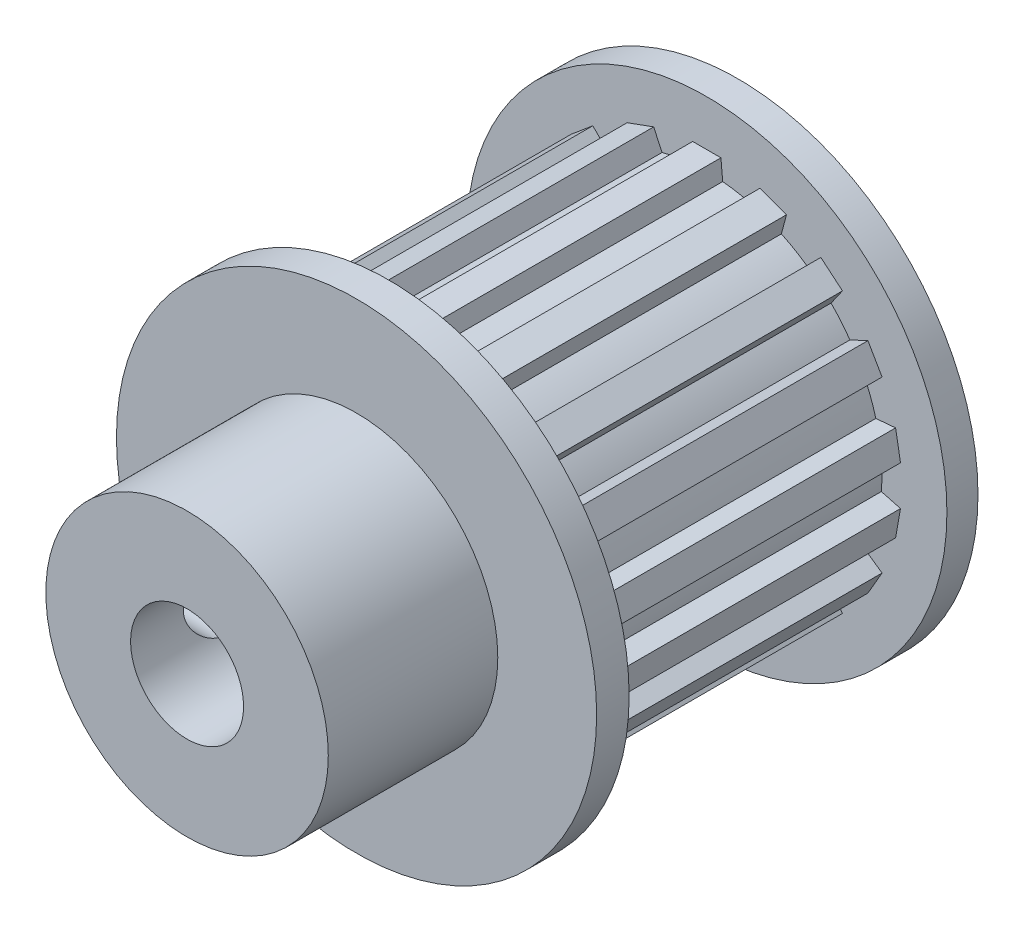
ISO-10303-21;
HEADER;
FILE_DESCRIPTION(('STEP AP214'),'2;1');
FILE_NAME('part.step','',(''),(''),'','','');
FILE_SCHEMA(('AUTOMOTIVE_DESIGN { 1 0 10303 214 1 1 1 1 }'));
ENDSEC;
DATA;
#1=APPLICATION_CONTEXT('core data for automotive mechanical design processes');
#2=APPLICATION_PROTOCOL_DEFINITION('international standard','automotive_design',2000,#1);
#3=PRODUCT_CONTEXT('',#1,'mechanical');
#4=PRODUCT('Part','Part','',(#3));
#5=PRODUCT_RELATED_PRODUCT_CATEGORY('part','',(#4));
#6=PRODUCT_DEFINITION_FORMATION('','',#4);
#7=PRODUCT_DEFINITION_CONTEXT('part definition',#1,'design');
#8=PRODUCT_DEFINITION('design','',#6,#7);
#9=PRODUCT_DEFINITION_SHAPE('','',#8);
#10=(LENGTH_UNIT() NAMED_UNIT(*) SI_UNIT(.MILLI.,.METRE.));
#11=(NAMED_UNIT(*) PLANE_ANGLE_UNIT() SI_UNIT($,.RADIAN.));
#12=(NAMED_UNIT(*) SI_UNIT($,.STERADIAN.) SOLID_ANGLE_UNIT());
#13=UNCERTAINTY_MEASURE_WITH_UNIT(LENGTH_MEASURE(1.E-05),#10,'distance_accuracy_value','');
#14=(GEOMETRIC_REPRESENTATION_CONTEXT(3) GLOBAL_UNCERTAINTY_ASSIGNED_CONTEXT((#13)) GLOBAL_UNIT_ASSIGNED_CONTEXT((#10,
#11,#12)) REPRESENTATION_CONTEXT('',''));
#15=CARTESIAN_POINT('',(0.,0.,0.));
#16=DIRECTION('',(0.,0.,1.));
#17=DIRECTION('',(1.,0.,0.));
#18=AXIS2_PLACEMENT_3D('',#15,#16,#17);
#19=CARTESIAN_POINT('',(0.,0.,0.));
#20=DIRECTION('',(0.,0.,1.));
#21=DIRECTION('',(1.,0.,0.));
#22=AXIS2_PLACEMENT_3D('',#19,#20,#21);
#23=CYLINDRICAL_SURFACE('',#22,6.2);
#24=DIRECTION('',(0.,0.,1.));
#25=VECTOR('',#24,1.);
#26=CARTESIAN_POINT('',(1.58442377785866,5.99413057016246,-20.0035115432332));
#27=LINE('',#26,#25);
#28=CARTESIAN_POINT('',(1.58442377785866,5.99413057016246,-18.4));
#29=VERTEX_POINT('',#28);
#30=CARTESIAN_POINT('',(1.58442377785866,5.99413057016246,-7.15));
#31=VERTEX_POINT('',#30);
#32=EDGE_CURVE('E502',#29,#31,#27,.T.);
#33=ORIENTED_EDGE('',*,*,#32,.F.);
#34=CARTESIAN_POINT('',(0.,0.,-18.4));
#35=DIRECTION('',(0.,0.,1.));
#36=DIRECTION('',(1.,0.,0.));
#37=AXIS2_PLACEMENT_3D('',#34,#35,#36);
#38=CIRCLE('',#37,6.2);
#39=CARTESIAN_POINT('',(0.561242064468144,6.17454511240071,-18.4));
#40=VERTEX_POINT('',#39);
#41=EDGE_CURVE('E984',#29,#40,#38,.T.);
#42=ORIENTED_EDGE('',*,*,#41,.T.);
#43=DIRECTION('',(0.,0.,1.));
#44=VECTOR('',#43,1.);
#45=CARTESIAN_POINT('',(0.561242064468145,6.17454511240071,-19.7228645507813));
#46=LINE('',#45,#44);
#47=CARTESIAN_POINT('',(0.561242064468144,6.17454511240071,-7.15));
#48=VERTEX_POINT('',#47);
#49=EDGE_CURVE('E896',#40,#48,#46,.T.);
#50=ORIENTED_EDGE('',*,*,#49,.T.);
#51=CARTESIAN_POINT('',(0.,0.,-7.15));
#52=DIRECTION('',(0.,0.,1.));
#53=DIRECTION('',(1.,0.,0.));
#54=AXIS2_PLACEMENT_3D('',#51,#52,#53);
#55=CIRCLE('',#54,6.2);
#56=EDGE_CURVE('E985',#31,#48,#55,.T.);
#57=ORIENTED_EDGE('',*,*,#56,.F.);
#58=EDGE_LOOP('',(#33,#42,#50,#57));
#59=FACE_BOUND('',#58,.T.);
#60=ADVANCED_FACE('F39',(#59),#23,.T.);
#61=DIRECTION('',(0.,0.,1.));
#62=VECTOR('',#61,1.);
#63=CARTESIAN_POINT('',(2.63921383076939,5.61021838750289,-20.0035115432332));
#64=LINE('',#63,#62);
#65=CARTESIAN_POINT('',(2.63921383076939,5.61021838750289,-18.4));
#66=VERTEX_POINT('',#65);
#67=CARTESIAN_POINT('',(2.63921383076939,5.61021838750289,-7.15));
#68=VERTEX_POINT('',#67);
#69=EDGE_CURVE('E508',#66,#68,#64,.T.);
#70=ORIENTED_EDGE('',*,*,#69,.T.);
#71=CARTESIAN_POINT('',(3.53898472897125,5.09073541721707,-7.15));
#72=VERTEX_POINT('',#71);
#73=EDGE_CURVE('E1002',#72,#68,#55,.T.);
#74=ORIENTED_EDGE('',*,*,#73,.F.);
#75=DIRECTION('',(0.,0.,1.));
#76=VECTOR('',#75,1.);
#77=CARTESIAN_POINT('',(3.53898472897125,5.09073541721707,-20.1548224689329));
#78=LINE('',#77,#76);
#79=CARTESIAN_POINT('',(3.53898472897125,5.09073541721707,-18.4));
#80=VERTEX_POINT('',#79);
#81=EDGE_CURVE('E522',#80,#72,#78,.T.);
#82=ORIENTED_EDGE('',*,*,#81,.F.);
#83=EDGE_CURVE('E991',#80,#66,#38,.T.);
#84=ORIENTED_EDGE('',*,*,#83,.T.);
#85=EDGE_LOOP('',(#70,#74,#82,#84));
#86=FACE_BOUND('',#85,.T.);
#87=ADVANCED_FACE('F975',(#86),#23,.T.);
#88=DIRECTION('',(0.,0.,1.));
#89=VECTOR('',#88,1.);
#90=CARTESIAN_POINT('',(4.39885745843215,4.36921652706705,-20.1548224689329));
#91=LINE('',#90,#89);
#92=CARTESIAN_POINT('',(4.39885745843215,4.36921652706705,-18.4));
#93=VERTEX_POINT('',#92);
#94=CARTESIAN_POINT('',(4.39885745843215,4.36921652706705,-7.15));
#95=VERTEX_POINT('',#94);
#96=EDGE_CURVE('E528',#93,#95,#91,.T.);
#97=ORIENTED_EDGE('',*,*,#96,.T.);
#98=CARTESIAN_POINT('',(5.06669189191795,3.57332244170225,-7.15));
#99=VERTEX_POINT('',#98);
#100=EDGE_CURVE('E1005',#99,#95,#55,.T.);
#101=ORIENTED_EDGE('',*,*,#100,.F.);
#102=DIRECTION('',(0.,0.,1.));
#103=VECTOR('',#102,1.);
#104=CARTESIAN_POINT('',(5.06669189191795,3.57332244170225,-20.1037964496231));
#105=LINE('',#104,#103);
#106=CARTESIAN_POINT('',(5.06669189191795,3.57332244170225,-18.4));
#107=VERTEX_POINT('',#106);
#108=EDGE_CURVE('E543',#107,#99,#105,.T.);
#109=ORIENTED_EDGE('',*,*,#108,.F.);
#110=EDGE_CURVE('E1875',#107,#93,#38,.T.);
#111=ORIENTED_EDGE('',*,*,#110,.T.);
#112=EDGE_LOOP('',(#97,#101,#109,#111));
#113=FACE_BOUND('',#112,.T.);
#114=ADVANCED_FACE('F980',(#113),#23,.T.);
#115=DIRECTION('',(0.,0.,1.));
#116=VECTOR('',#115,1.);
#117=CARTESIAN_POINT('',(5.6279339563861,2.60122267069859,-20.1037964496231));
#118=LINE('',#117,#116);
#119=CARTESIAN_POINT('',(5.6279339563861,2.60122267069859,-18.4));
#120=VERTEX_POINT('',#119);
#121=CARTESIAN_POINT('',(5.6279339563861,2.60122267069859,-7.15));
#122=VERTEX_POINT('',#121);
#123=EDGE_CURVE('E551',#120,#122,#118,.T.);
#124=ORIENTED_EDGE('',*,*,#123,.T.);
#125=CARTESIAN_POINT('',(5.98328123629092,1.6249140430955,-7.15));
#126=VERTEX_POINT('',#125);
#127=EDGE_CURVE('E1008',#126,#122,#55,.T.);
#128=ORIENTED_EDGE('',*,*,#127,.F.);
#129=DIRECTION('',(0.,0.,1.));
#130=VECTOR('',#129,1.);
#131=CARTESIAN_POINT('',(5.98328123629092,1.6249140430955,-19.8575278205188));
#132=LINE('',#131,#130);
#133=CARTESIAN_POINT('',(5.98328123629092,1.6249140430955,-18.4));
#134=VERTEX_POINT('',#133);
#135=EDGE_CURVE('E566',#134,#126,#132,.T.);
#136=ORIENTED_EDGE('',*,*,#135,.F.);
#137=EDGE_CURVE('E1871',#134,#120,#38,.T.);
#138=ORIENTED_EDGE('',*,*,#137,.T.);
#139=EDGE_LOOP('',(#124,#128,#136,#138));
#140=FACE_BOUND('',#139,.T.);
#141=ADVANCED_FACE('F1542',(#140),#23,.T.);
#142=DIRECTION('',(0.,0.,1.));
#143=VECTOR('',#142,1.);
#144=CARTESIAN_POINT('',(6.17819855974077,0.519482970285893,-19.8575278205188));
#145=LINE('',#144,#143);
#146=CARTESIAN_POINT('',(6.17819855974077,0.519482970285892,-18.4));
#147=VERTEX_POINT('',#146);
#148=CARTESIAN_POINT('',(6.17819855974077,0.519482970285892,-7.15));
#149=VERTEX_POINT('',#148);
#150=EDGE_CURVE('E574',#147,#149,#145,.T.);
#151=ORIENTED_EDGE('',*,*,#150,.T.);
#152=CARTESIAN_POINT('',(6.17819855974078,-0.519482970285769,-7.15));
#153=VERTEX_POINT('',#152);
#154=EDGE_CURVE('E1905',#153,#149,#55,.T.);
#155=ORIENTED_EDGE('',*,*,#154,.F.);
#156=DIRECTION('',(0.,0.,1.));
#157=VECTOR('',#156,1.);
#158=CARTESIAN_POINT('',(6.17819855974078,-0.519482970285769,-19.8575278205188));
#159=LINE('',#158,#157);
#160=CARTESIAN_POINT('',(6.17819855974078,-0.519482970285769,-18.4));
#161=VERTEX_POINT('',#160);
#162=EDGE_CURVE('E589',#161,#153,#159,.T.);
#163=ORIENTED_EDGE('',*,*,#162,.F.);
#164=EDGE_CURVE('E1867',#161,#147,#38,.T.);
#165=ORIENTED_EDGE('',*,*,#164,.T.);
#166=EDGE_LOOP('',(#151,#155,#163,#165));
#167=FACE_BOUND('',#166,.T.);
#168=ADVANCED_FACE('F1550',(#167),#23,.T.);
#169=DIRECTION('',(0.,0.,1.));
#170=VECTOR('',#169,1.);
#171=CARTESIAN_POINT('',(5.98328123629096,-1.62491404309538,-19.8575278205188));
#172=LINE('',#171,#170);
#173=CARTESIAN_POINT('',(5.98328123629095,-1.62491404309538,-18.4));
#174=VERTEX_POINT('',#173);
#175=CARTESIAN_POINT('',(5.98328123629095,-1.62491404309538,-7.15));
#176=VERTEX_POINT('',#175);
#177=EDGE_CURVE('E597',#174,#176,#172,.T.);
#178=ORIENTED_EDGE('',*,*,#177,.T.);
#179=CARTESIAN_POINT('',(5.62793395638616,-2.60122267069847,-7.15));
#180=VERTEX_POINT('',#179);
#181=EDGE_CURVE('E1907',#180,#176,#55,.T.);
#182=ORIENTED_EDGE('',*,*,#181,.F.);
#183=DIRECTION('',(0.,0.,1.));
#184=VECTOR('',#183,1.);
#185=CARTESIAN_POINT('',(5.62793395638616,-2.60122267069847,-20.1037964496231));
#186=LINE('',#185,#184);
#187=CARTESIAN_POINT('',(5.62793395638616,-2.60122267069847,-18.4));
#188=VERTEX_POINT('',#187);
#189=EDGE_CURVE('E612',#188,#180,#186,.T.);
#190=ORIENTED_EDGE('',*,*,#189,.F.);
#191=EDGE_CURVE('E1863',#188,#174,#38,.T.);
#192=ORIENTED_EDGE('',*,*,#191,.T.);
#193=EDGE_LOOP('',(#178,#182,#190,#192));
#194=FACE_BOUND('',#193,.T.);
#195=ADVANCED_FACE('F1558',(#194),#23,.T.);
#196=DIRECTION('',(0.,0.,1.));
#197=VECTOR('',#196,1.);
#198=CARTESIAN_POINT('',(5.06669189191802,-3.57332244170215,-20.1037964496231));
#199=LINE('',#198,#197);
#200=CARTESIAN_POINT('',(5.06669189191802,-3.57332244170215,-18.4));
#201=VERTEX_POINT('',#200);
#202=CARTESIAN_POINT('',(5.06669189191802,-3.57332244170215,-7.15));
#203=VERTEX_POINT('',#202);
#204=EDGE_CURVE('E620',#201,#203,#199,.T.);
#205=ORIENTED_EDGE('',*,*,#204,.T.);
#206=CARTESIAN_POINT('',(4.39885745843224,-4.36921652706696,-7.15));
#207=VERTEX_POINT('',#206);
#208=EDGE_CURVE('E1909',#207,#203,#55,.T.);
#209=ORIENTED_EDGE('',*,*,#208,.F.);
#210=DIRECTION('',(0.,0.,1.));
#211=VECTOR('',#210,1.);
#212=CARTESIAN_POINT('',(4.39885745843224,-4.36921652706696,-20.1548224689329));
#213=LINE('',#212,#211);
#214=CARTESIAN_POINT('',(4.39885745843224,-4.36921652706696,-18.4));
#215=VERTEX_POINT('',#214);
#216=EDGE_CURVE('E635',#215,#207,#213,.T.);
#217=ORIENTED_EDGE('',*,*,#216,.F.);
#218=EDGE_CURVE('E1859',#215,#201,#38,.T.);
#219=ORIENTED_EDGE('',*,*,#218,.T.);
#220=EDGE_LOOP('',(#205,#209,#217,#219));
#221=FACE_BOUND('',#220,.T.);
#222=ADVANCED_FACE('F1566',(#221),#23,.T.);
#223=DIRECTION('',(0.,0.,1.));
#224=VECTOR('',#223,1.);
#225=CARTESIAN_POINT('',(3.53898472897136,-5.090735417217,-20.1548224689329));
#226=LINE('',#225,#224);
#227=CARTESIAN_POINT('',(3.53898472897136,-5.090735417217,-18.4));
#228=VERTEX_POINT('',#227);
#229=CARTESIAN_POINT('',(3.53898472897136,-5.090735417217,-7.15));
#230=VERTEX_POINT('',#229);
#231=EDGE_CURVE('E643',#228,#230,#226,.T.);
#232=ORIENTED_EDGE('',*,*,#231,.T.);
#233=CARTESIAN_POINT('',(2.63921383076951,-5.61021838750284,-7.15));
#234=VERTEX_POINT('',#233);
#235=EDGE_CURVE('E1915',#234,#230,#55,.T.);
#236=ORIENTED_EDGE('',*,*,#235,.F.);
#237=DIRECTION('',(0.,0.,1.));
#238=VECTOR('',#237,1.);
#239=CARTESIAN_POINT('',(2.63921383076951,-5.61021838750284,-20.0035115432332));
#240=LINE('',#239,#238);
#241=CARTESIAN_POINT('',(2.63921383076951,-5.61021838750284,-18.4));
#242=VERTEX_POINT('',#241);
#243=EDGE_CURVE('E658',#242,#234,#240,.T.);
#244=ORIENTED_EDGE('',*,*,#243,.F.);
#245=EDGE_CURVE('E1855',#242,#228,#38,.T.);
#246=ORIENTED_EDGE('',*,*,#245,.T.);
#247=EDGE_LOOP('',(#232,#236,#244,#246));
#248=FACE_BOUND('',#247,.T.);
#249=ADVANCED_FACE('F1574',(#248),#23,.T.);
#250=DIRECTION('',(0.,0.,1.));
#251=VECTOR('',#250,1.);
#252=CARTESIAN_POINT('',(1.58442377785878,-5.99413057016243,-20.0035115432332));
#253=LINE('',#252,#251);
#254=CARTESIAN_POINT('',(1.58442377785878,-5.99413057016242,-18.4));
#255=VERTEX_POINT('',#254);
#256=CARTESIAN_POINT('',(1.58442377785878,-5.99413057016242,-7.15));
#257=VERTEX_POINT('',#256);
#258=EDGE_CURVE('E666',#255,#257,#253,.T.);
#259=ORIENTED_EDGE('',*,*,#258,.T.);
#260=CARTESIAN_POINT('',(0.561242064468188,-6.17454511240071,-7.15));
#261=VERTEX_POINT('',#260);
#262=EDGE_CURVE('E1919',#261,#257,#55,.T.);
#263=ORIENTED_EDGE('',*,*,#262,.F.);
#264=DIRECTION('',(0.,0.,1.));
#265=VECTOR('',#264,1.);
#266=CARTESIAN_POINT('',(0.561242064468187,-6.17454511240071,-19.7228645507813));
#267=LINE('',#266,#265);
#268=CARTESIAN_POINT('',(0.561242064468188,-6.17454511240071,-18.4));
#269=VERTEX_POINT('',#268);
#270=EDGE_CURVE('E681',#269,#261,#267,.T.);
#271=ORIENTED_EDGE('',*,*,#270,.F.);
#272=EDGE_CURVE('E1851',#269,#255,#38,.T.);
#273=ORIENTED_EDGE('',*,*,#272,.T.);
#274=EDGE_LOOP('',(#259,#263,#271,#273));
#275=FACE_BOUND('',#274,.T.);
#276=ADVANCED_FACE('F1582',(#275),#23,.T.);
#277=DIRECTION('',(0.,0.,1.));
#278=VECTOR('',#277,1.);
#279=CARTESIAN_POINT('',(-0.561242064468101,-6.17454511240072,-19.7228645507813));
#280=LINE('',#279,#278);
#281=CARTESIAN_POINT('',(-0.561242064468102,-6.17454511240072,-18.4));
#282=VERTEX_POINT('',#281);
#283=CARTESIAN_POINT('',(-0.561242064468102,-6.17454511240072,-7.15));
#284=VERTEX_POINT('',#283);
#285=EDGE_CURVE('E689',#282,#284,#280,.T.);
#286=ORIENTED_EDGE('',*,*,#285,.T.);
#287=CARTESIAN_POINT('',(-1.5844237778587,-5.99413057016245,-7.15));
#288=VERTEX_POINT('',#287);
#289=EDGE_CURVE('E1923',#288,#284,#55,.T.);
#290=ORIENTED_EDGE('',*,*,#289,.F.);
#291=DIRECTION('',(0.,0.,1.));
#292=VECTOR('',#291,1.);
#293=CARTESIAN_POINT('',(-1.5844237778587,-5.99413057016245,-20.0035115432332));
#294=LINE('',#293,#292);
#295=CARTESIAN_POINT('',(-1.5844237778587,-5.99413057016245,-18.4));
#296=VERTEX_POINT('',#295);
#297=EDGE_CURVE('E704',#296,#288,#294,.T.);
#298=ORIENTED_EDGE('',*,*,#297,.F.);
#299=EDGE_CURVE('E1847',#296,#282,#38,.T.);
#300=ORIENTED_EDGE('',*,*,#299,.T.);
#301=EDGE_LOOP('',(#286,#290,#298,#300));
#302=FACE_BOUND('',#301,.T.);
#303=ADVANCED_FACE('F1590',(#302),#23,.T.);
#304=DIRECTION('',(0.,0.,1.));
#305=VECTOR('',#304,1.);
#306=CARTESIAN_POINT('',(-2.63921383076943,-5.61021838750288,-20.0035115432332));
#307=LINE('',#306,#305);
#308=CARTESIAN_POINT('',(-2.63921383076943,-5.61021838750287,-18.4));
#309=VERTEX_POINT('',#308);
#310=CARTESIAN_POINT('',(-2.63921383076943,-5.61021838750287,-7.15));
#311=VERTEX_POINT('',#310);
#312=EDGE_CURVE('E712',#309,#311,#307,.T.);
#313=ORIENTED_EDGE('',*,*,#312,.T.);
#314=CARTESIAN_POINT('',(-3.53898472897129,-5.09073541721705,-7.15));
#315=VERTEX_POINT('',#314);
#316=EDGE_CURVE('E1927',#315,#311,#55,.T.);
#317=ORIENTED_EDGE('',*,*,#316,.F.);
#318=DIRECTION('',(0.,0.,1.));
#319=VECTOR('',#318,1.);
#320=CARTESIAN_POINT('',(-3.53898472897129,-5.09073541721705,-20.1548224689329));
#321=LINE('',#320,#319);
#322=CARTESIAN_POINT('',(-3.53898472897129,-5.09073541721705,-18.4));
#323=VERTEX_POINT('',#322);
#324=EDGE_CURVE('E727',#323,#315,#321,.T.);
#325=ORIENTED_EDGE('',*,*,#324,.F.);
#326=EDGE_CURVE('E1843',#323,#309,#38,.T.);
#327=ORIENTED_EDGE('',*,*,#326,.T.);
#328=EDGE_LOOP('',(#313,#317,#325,#327));
#329=FACE_BOUND('',#328,.T.);
#330=ADVANCED_FACE('F1598',(#329),#23,.T.);
#331=DIRECTION('',(0.,0.,1.));
#332=VECTOR('',#331,1.);
#333=CARTESIAN_POINT('',(-4.39885745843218,-4.36921652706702,-20.1548224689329));
#334=LINE('',#333,#332);
#335=CARTESIAN_POINT('',(-4.39885745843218,-4.36921652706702,-18.4));
#336=VERTEX_POINT('',#335);
#337=CARTESIAN_POINT('',(-4.39885745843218,-4.36921652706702,-7.15));
#338=VERTEX_POINT('',#337);
#339=EDGE_CURVE('E735',#336,#338,#334,.T.);
#340=ORIENTED_EDGE('',*,*,#339,.T.);
#341=CARTESIAN_POINT('',(-5.06669189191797,-3.57332244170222,-7.15));
#342=VERTEX_POINT('',#341);
#343=EDGE_CURVE('E1931',#342,#338,#55,.T.);
#344=ORIENTED_EDGE('',*,*,#343,.F.);
#345=DIRECTION('',(0.,0.,1.));
#346=VECTOR('',#345,1.);
#347=CARTESIAN_POINT('',(-5.06669189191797,-3.57332244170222,-20.1037964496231));
#348=LINE('',#347,#346);
#349=CARTESIAN_POINT('',(-5.06669189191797,-3.57332244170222,-18.4));
#350=VERTEX_POINT('',#349);
#351=EDGE_CURVE('E750',#350,#342,#348,.T.);
#352=ORIENTED_EDGE('',*,*,#351,.F.);
#353=EDGE_CURVE('E1839',#350,#336,#38,.T.);
#354=ORIENTED_EDGE('',*,*,#353,.T.);
#355=EDGE_LOOP('',(#340,#344,#352,#354));
#356=FACE_BOUND('',#355,.T.);
#357=ADVANCED_FACE('F1606',(#356),#23,.T.);
#358=DIRECTION('',(0.,0.,1.));
#359=VECTOR('',#358,1.);
#360=CARTESIAN_POINT('',(-5.62793395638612,-2.60122267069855,-20.1037964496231));
#361=LINE('',#360,#359);
#362=CARTESIAN_POINT('',(-5.62793395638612,-2.60122267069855,-18.4));
#363=VERTEX_POINT('',#362);
#364=CARTESIAN_POINT('',(-5.62793395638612,-2.60122267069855,-7.15));
#365=VERTEX_POINT('',#364);
#366=EDGE_CURVE('E758',#363,#365,#361,.T.);
#367=ORIENTED_EDGE('',*,*,#366,.T.);
#368=CARTESIAN_POINT('',(-5.98328123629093,-1.62491404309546,-7.15));
#369=VERTEX_POINT('',#368);
#370=EDGE_CURVE('E1935',#369,#365,#55,.T.);
#371=ORIENTED_EDGE('',*,*,#370,.F.);
#372=DIRECTION('',(0.,0.,1.));
#373=VECTOR('',#372,1.);
#374=CARTESIAN_POINT('',(-5.98328123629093,-1.62491404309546,-19.8575278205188));
#375=LINE('',#374,#373);
#376=CARTESIAN_POINT('',(-5.98328123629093,-1.62491404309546,-18.4));
#377=VERTEX_POINT('',#376);
#378=EDGE_CURVE('E773',#377,#369,#375,.T.);
#379=ORIENTED_EDGE('',*,*,#378,.F.);
#380=EDGE_CURVE('E1835',#377,#363,#38,.T.);
#381=ORIENTED_EDGE('',*,*,#380,.T.);
#382=EDGE_LOOP('',(#367,#371,#379,#381));
#383=FACE_BOUND('',#382,.T.);
#384=ADVANCED_FACE('F1614',(#383),#23,.T.);
#385=DIRECTION('',(0.,0.,1.));
#386=VECTOR('',#385,1.);
#387=CARTESIAN_POINT('',(-6.17819855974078,-0.519482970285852,-19.8575278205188));
#388=LINE('',#387,#386);
#389=CARTESIAN_POINT('',(-6.17819855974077,-0.519482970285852,-18.4));
#390=VERTEX_POINT('',#389);
#391=CARTESIAN_POINT('',(-6.17819855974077,-0.519482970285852,-7.15));
#392=VERTEX_POINT('',#391);
#393=EDGE_CURVE('E781',#390,#392,#388,.T.);
#394=ORIENTED_EDGE('',*,*,#393,.T.);
#395=CARTESIAN_POINT('',(-6.17819855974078,0.51948297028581,-7.15));
#396=VERTEX_POINT('',#395);
#397=EDGE_CURVE('E1939',#396,#392,#55,.T.);
#398=ORIENTED_EDGE('',*,*,#397,.F.);
#399=DIRECTION('',(0.,0.,1.));
#400=VECTOR('',#399,1.);
#401=CARTESIAN_POINT('',(-6.17819855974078,0.519482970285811,-19.8575278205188));
#402=LINE('',#401,#400);
#403=CARTESIAN_POINT('',(-6.17819855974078,0.51948297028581,-18.4));
#404=VERTEX_POINT('',#403);
#405=EDGE_CURVE('E796',#404,#396,#402,.T.);
#406=ORIENTED_EDGE('',*,*,#405,.F.);
#407=EDGE_CURVE('E1831',#404,#390,#38,.T.);
#408=ORIENTED_EDGE('',*,*,#407,.T.);
#409=EDGE_LOOP('',(#394,#398,#406,#408));
#410=FACE_BOUND('',#409,.T.);
#411=ADVANCED_FACE('F1622',(#410),#23,.T.);
#412=DIRECTION('',(0.,0.,1.));
#413=VECTOR('',#412,1.);
#414=CARTESIAN_POINT('',(-5.98328123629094,1.62491404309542,-19.8575278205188));
#415=LINE('',#414,#413);
#416=CARTESIAN_POINT('',(-5.98328123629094,1.62491404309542,-18.4));
#417=VERTEX_POINT('',#416);
#418=CARTESIAN_POINT('',(-5.98328123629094,1.62491404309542,-7.15));
#419=VERTEX_POINT('',#418);
#420=EDGE_CURVE('E804',#417,#419,#415,.T.);
#421=ORIENTED_EDGE('',*,*,#420,.T.);
#422=CARTESIAN_POINT('',(-5.62793395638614,2.60122267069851,-7.15));
#423=VERTEX_POINT('',#422);
#424=EDGE_CURVE('E1825',#423,#419,#55,.T.);
#425=ORIENTED_EDGE('',*,*,#424,.F.);
#426=DIRECTION('',(0.,0.,1.));
#427=VECTOR('',#426,1.);
#428=CARTESIAN_POINT('',(-5.62793395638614,2.60122267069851,-20.1037964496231));
#429=LINE('',#428,#427);
#430=CARTESIAN_POINT('',(-5.62793395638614,2.60122267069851,-18.4));
#431=VERTEX_POINT('',#430);
#432=EDGE_CURVE('E819',#431,#423,#429,.T.);
#433=ORIENTED_EDGE('',*,*,#432,.F.);
#434=EDGE_CURVE('E1829',#431,#417,#38,.T.);
#435=ORIENTED_EDGE('',*,*,#434,.T.);
#436=EDGE_LOOP('',(#421,#425,#433,#435));
#437=FACE_BOUND('',#436,.T.);
#438=ADVANCED_FACE('F1630',(#437),#23,.T.);
#439=DIRECTION('',(0.,0.,1.));
#440=VECTOR('',#439,1.);
#441=CARTESIAN_POINT('',(-5.066691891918,3.57332244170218,-20.1037964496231));
#442=LINE('',#441,#440);
#443=CARTESIAN_POINT('',(-5.066691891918,3.57332244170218,-18.4));
#444=VERTEX_POINT('',#443);
#445=CARTESIAN_POINT('',(-5.066691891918,3.57332244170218,-7.15));
#446=VERTEX_POINT('',#445);
#447=EDGE_CURVE('E827',#444,#446,#442,.T.);
#448=ORIENTED_EDGE('',*,*,#447,.T.);
#449=CARTESIAN_POINT('',(-4.39885745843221,4.36921652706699,-7.15));
#450=VERTEX_POINT('',#449);
#451=EDGE_CURVE('E1813',#450,#446,#55,.T.);
#452=ORIENTED_EDGE('',*,*,#451,.F.);
#453=DIRECTION('',(0.,0.,1.));
#454=VECTOR('',#453,1.);
#455=CARTESIAN_POINT('',(-4.39885745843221,4.36921652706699,-20.1548224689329));
#456=LINE('',#455,#454);
#457=CARTESIAN_POINT('',(-4.39885745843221,4.36921652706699,-18.4));
#458=VERTEX_POINT('',#457);
#459=EDGE_CURVE('E842',#458,#450,#456,.T.);
#460=ORIENTED_EDGE('',*,*,#459,.F.);
#461=EDGE_CURVE('E1827',#458,#444,#38,.T.);
#462=ORIENTED_EDGE('',*,*,#461,.T.);
#463=EDGE_LOOP('',(#448,#452,#460,#462));
#464=FACE_BOUND('',#463,.T.);
#465=ADVANCED_FACE('F1638',(#464),#23,.T.);
#466=DIRECTION('',(0.,0.,1.));
#467=VECTOR('',#466,1.);
#468=CARTESIAN_POINT('',(-3.53898472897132,5.09073541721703,-20.1548224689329));
#469=LINE('',#468,#467);
#470=CARTESIAN_POINT('',(-3.53898472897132,5.09073541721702,-18.4));
#471=VERTEX_POINT('',#470);
#472=CARTESIAN_POINT('',(-3.53898472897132,5.09073541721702,-7.15));
#473=VERTEX_POINT('',#472);
#474=EDGE_CURVE('E850',#471,#473,#469,.T.);
#475=ORIENTED_EDGE('',*,*,#474,.T.);
#476=CARTESIAN_POINT('',(-2.63921383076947,5.61021838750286,-7.15));
#477=VERTEX_POINT('',#476);
#478=EDGE_CURVE('E1010',#477,#473,#55,.T.);
#479=ORIENTED_EDGE('',*,*,#478,.F.);
#480=DIRECTION('',(0.,0.,1.));
#481=VECTOR('',#480,1.);
#482=CARTESIAN_POINT('',(-2.63921383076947,5.61021838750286,-20.0035115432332));
#483=LINE('',#482,#481);
#484=CARTESIAN_POINT('',(-2.63921383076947,5.61021838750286,-18.4));
#485=VERTEX_POINT('',#484);
#486=EDGE_CURVE('E865',#485,#477,#483,.T.);
#487=ORIENTED_EDGE('',*,*,#486,.F.);
#488=EDGE_CURVE('E1013',#485,#471,#38,.T.);
#489=ORIENTED_EDGE('',*,*,#488,.T.);
#490=EDGE_LOOP('',(#475,#479,#487,#489));
#491=FACE_BOUND('',#490,.T.);
#492=ADVANCED_FACE('F956',(#491),#23,.T.);
#493=CARTESIAN_POINT('',(0.,0.,0.));
#494=DIRECTION('',(0.,0.,1.));
#495=DIRECTION('',(1.,0.,0.));
#496=AXIS2_PLACEMENT_3D('',#493,#494,#495);
#497=CYLINDRICAL_SURFACE('',#496,8.5);
#498=CARTESIAN_POINT('',(0.,0.,-18.4));
#499=DIRECTION('',(0.,0.,1.));
#500=DIRECTION('',(1.,0.,0.));
#501=AXIS2_PLACEMENT_3D('',#498,#499,#500);
#502=CIRCLE('',#501,8.5);
#503=CARTESIAN_POINT('',(8.5,0.,-18.4));
#504=VERTEX_POINT('',#503);
#505=EDGE_CURVE('E992',#504,#504,#502,.T.);
#506=ORIENTED_EDGE('',*,*,#505,.F.);
#507=EDGE_LOOP('',(#506));
#508=FACE_BOUND('',#507,.T.);
#509=CARTESIAN_POINT('',(0.,0.,-19.5));
#510=DIRECTION('',(0.,0.,-1.));
#511=DIRECTION('',(-1.,0.,0.));
#512=AXIS2_PLACEMENT_3D('',#509,#510,#511);
#513=CIRCLE('',#512,8.5);
#514=CARTESIAN_POINT('',(-8.5,0.,-19.5));
#515=VERTEX_POINT('',#514);
#516=EDGE_CURVE('E43',#515,#515,#513,.F.);
#517=ORIENTED_EDGE('',*,*,#516,.T.);
#518=EDGE_LOOP('',(#517));
#519=FACE_BOUND('',#518,.T.);
#520=ADVANCED_FACE('F952',(#508,#519),#497,.T.);
#521=CARTESIAN_POINT('',(8.5,0.,-20.));
#522=DIRECTION('',(0.,0.,-1.));
#523=DIRECTION('',(-1.,0.,0.));
#524=AXIS2_PLACEMENT_3D('',#521,#522,#523);
#525=PLANE('',#524);
#526=CARTESIAN_POINT('',(0.,0.,-20.));
#527=DIRECTION('',(0.,0.,-1.));
#528=DIRECTION('',(-1.,0.,0.));
#529=AXIS2_PLACEMENT_3D('',#526,#527,#528);
#530=CIRCLE('',#529,2.);
#531=CARTESIAN_POINT('',(-2.,0.,-20.));
#532=VERTEX_POINT('',#531);
#533=EDGE_CURVE('E1017',#532,#532,#530,.T.);
#534=ORIENTED_EDGE('',*,*,#533,.F.);
#535=EDGE_LOOP('',(#534));
#536=FACE_BOUND('',#535,.T.);
#537=CARTESIAN_POINT('',(0.,0.,-20.));
#538=DIRECTION('',(0.,0.,-1.));
#539=DIRECTION('',(-1.,0.,0.));
#540=AXIS2_PLACEMENT_3D('',#537,#538,#539);
#541=CIRCLE('',#540,5.);
#542=CARTESIAN_POINT('',(-5.,0.,-20.));
#543=VERTEX_POINT('',#542);
#544=EDGE_CURVE('E909',#543,#543,#541,.T.);
#545=ORIENTED_EDGE('',*,*,#544,.T.);
#546=EDGE_LOOP('',(#545));
#547=FACE_BOUND('',#546,.T.);
#548=ADVANCED_FACE('F949',(#536,#547),#525,.T.);
#549=CARTESIAN_POINT('',(0.,0.,0.));
#550=DIRECTION('',(0.,0.,1.));
#551=DIRECTION('',(1.,0.,0.));
#552=AXIS2_PLACEMENT_3D('',#549,#550,#551);
#553=PLANE('',#552);
#554=CARTESIAN_POINT('',(0.,0.,0.));
#555=DIRECTION('',(0.,0.,-1.));
#556=DIRECTION('',(-1.,0.,0.));
#557=AXIS2_PLACEMENT_3D('',#554,#555,#556);
#558=CIRCLE('',#557,2.);
#559=CARTESIAN_POINT('',(-2.,0.,0.));
#560=VERTEX_POINT('',#559);
#561=EDGE_CURVE('E1016',#560,#560,#558,.T.);
#562=ORIENTED_EDGE('',*,*,#561,.T.);
#563=EDGE_LOOP('',(#562));
#564=FACE_BOUND('',#563,.T.);
#565=CARTESIAN_POINT('',(0.,0.,0.));
#566=DIRECTION('',(0.,0.,1.));
#567=DIRECTION('',(1.,0.,0.));
#568=AXIS2_PLACEMENT_3D('',#565,#566,#567);
#569=CIRCLE('',#568,5.);
#570=CARTESIAN_POINT('',(5.,0.,0.));
#571=VERTEX_POINT('',#570);
#572=EDGE_CURVE('E922',#571,#571,#569,.T.);
#573=ORIENTED_EDGE('',*,*,#572,.T.);
#574=EDGE_LOOP('',(#573));
#575=FACE_BOUND('',#574,.T.);
#576=ADVANCED_FACE('F41',(#564,#575),#553,.T.);
#577=CARTESIAN_POINT('',(0.,0.,0.));
#578=DIRECTION('',(0.,0.,1.));
#579=DIRECTION('',(1.,0.,0.));
#580=AXIS2_PLACEMENT_3D('',#577,#578,#579);
#581=CYLINDRICAL_SURFACE('',#580,8.5);
#582=CARTESIAN_POINT('',(0.,0.,-7.15));
#583=DIRECTION('',(0.,0.,1.));
#584=DIRECTION('',(1.,0.,0.));
#585=AXIS2_PLACEMENT_3D('',#582,#583,#584);
#586=CIRCLE('',#585,8.5);
#587=CARTESIAN_POINT('',(8.5,0.,-7.15));
#588=VERTEX_POINT('',#587);
#589=EDGE_CURVE('E12',#588,#588,#586,.T.);
#590=ORIENTED_EDGE('',*,*,#589,.T.);
#591=EDGE_LOOP('',(#590));
#592=FACE_BOUND('',#591,.T.);
#593=CARTESIAN_POINT('',(0.,0.,-6.));
#594=DIRECTION('',(0.,0.,1.));
#595=DIRECTION('',(1.,0.,0.));
#596=AXIS2_PLACEMENT_3D('',#593,#594,#595);
#597=CIRCLE('',#596,8.5);
#598=CARTESIAN_POINT('',(8.5,0.,-6.));
#599=VERTEX_POINT('',#598);
#600=EDGE_CURVE('E942',#599,#599,#597,.F.);
#601=ORIENTED_EDGE('',*,*,#600,.T.);
#602=EDGE_LOOP('',(#601));
#603=FACE_BOUND('',#602,.T.);
#604=ADVANCED_FACE('F966',(#592,#603),#581,.T.);
#605=CARTESIAN_POINT('',(6.2,0.,-7.15));
#606=DIRECTION('',(0.,0.,-1.));
#607=DIRECTION('',(-1.,0.,0.));
#608=AXIS2_PLACEMENT_3D('',#605,#606,#607);
#609=PLANE('',#608);
#610=DIRECTION('',(-0.422618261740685,-0.906307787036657,0.));
#611=VECTOR('',#610,1.);
#612=CARTESIAN_POINT('',(1.58442377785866,5.99413057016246,-7.15));
#613=LINE('',#612,#611);
#614=CARTESIAN_POINT('',(1.88138659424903,6.63096938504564,-7.15));
#615=VERTEX_POINT('',#614);
#616=EDGE_CURVE('E996',#615,#31,#613,.T.);
#617=ORIENTED_EDGE('',*,*,#616,.T.);
#618=ORIENTED_EDGE('',*,*,#56,.T.);
#619=DIRECTION('',(-0.0871557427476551,0.996194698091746,0.));
#620=VECTOR('',#619,1.);
#621=CARTESIAN_POINT('',(0.5,6.87454511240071,-7.15));
#622=LINE('',#621,#620);
#623=CARTESIAN_POINT('',(0.499999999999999,6.87454511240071,-7.15));
#624=VERTEX_POINT('',#623);
#625=EDGE_CURVE('E884',#48,#624,#622,.T.);
#626=ORIENTED_EDGE('',*,*,#625,.T.);
#627=DIRECTION('',(-1.,0.,0.));
#628=VECTOR('',#627,1.);
#629=CARTESIAN_POINT('',(-0.5,6.87454511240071,-7.15));
#630=LINE('',#629,#628);
#631=CARTESIAN_POINT('',(-0.5,6.87454511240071,-7.15));
#632=VERTEX_POINT('',#631);
#633=EDGE_CURVE('E892',#624,#632,#630,.T.);
#634=ORIENTED_EDGE('',*,*,#633,.T.);
#635=DIRECTION('',(-0.0871557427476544,-0.996194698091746,0.));
#636=VECTOR('',#635,1.);
#637=CARTESIAN_POINT('',(-0.561242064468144,6.17454511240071,-7.15));
#638=LINE('',#637,#636);
#639=CARTESIAN_POINT('',(-0.561242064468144,6.17454511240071,-7.15));
#640=VERTEX_POINT('',#639);
#641=EDGE_CURVE('E894',#632,#640,#638,.T.);
#642=ORIENTED_EDGE('',*,*,#641,.T.);
#643=CARTESIAN_POINT('',(-1.58442377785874,5.99413057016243,-7.15));
#644=VERTEX_POINT('',#643);
#645=EDGE_CURVE('E48',#640,#644,#55,.T.);
#646=ORIENTED_EDGE('',*,*,#645,.T.);
#647=DIRECTION('',(-0.422618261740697,0.906307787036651,0.));
#648=VECTOR('',#647,1.);
#649=CARTESIAN_POINT('',(-1.88138659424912,6.63096938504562,-7.15));
#650=LINE('',#649,#648);
#651=CARTESIAN_POINT('',(-1.88138659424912,6.63096938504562,-7.15));
#652=VERTEX_POINT('',#651);
#653=EDGE_CURVE('E861',#644,#652,#650,.T.);
#654=ORIENTED_EDGE('',*,*,#653,.T.);
#655=DIRECTION('',(-0.939692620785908,-0.342020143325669,0.));
#656=VECTOR('',#655,1.);
#657=CARTESIAN_POINT('',(-2.82107921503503,6.28894924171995,-7.15));
#658=LINE('',#657,#656);
#659=CARTESIAN_POINT('',(-2.82107921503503,6.28894924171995,-7.15));
#660=VERTEX_POINT('',#659);
#661=EDGE_CURVE('E869',#652,#660,#658,.T.);
#662=ORIENTED_EDGE('',*,*,#661,.T.);
#663=DIRECTION('',(0.258819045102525,-0.965925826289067,0.));
#664=VECTOR('',#663,1.);
#665=CARTESIAN_POINT('',(-2.63921383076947,5.61021838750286,-7.15));
#666=LINE('',#665,#664);
#667=EDGE_CURVE('E871',#660,#477,#666,.T.);
#668=ORIENTED_EDGE('',*,*,#667,.T.);
#669=ORIENTED_EDGE('',*,*,#478,.T.);
#670=DIRECTION('',(-0.707106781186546,0.707106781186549,0.));
#671=VECTOR('',#670,1.);
#672=CARTESIAN_POINT('',(-4.03585019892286,5.58760088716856,-7.15));
#673=LINE('',#672,#671);
#674=CARTESIAN_POINT('',(-4.03585019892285,5.58760088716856,-7.15));
#675=VERTEX_POINT('',#674);
#676=EDGE_CURVE('E838',#473,#675,#673,.T.);
#677=ORIENTED_EDGE('',*,*,#676,.T.);
#678=DIRECTION('',(-0.766044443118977,-0.642787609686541,0.));
#679=VECTOR('',#678,1.);
#680=CARTESIAN_POINT('',(-4.80189464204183,4.94481327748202,-7.15));
#681=LINE('',#680,#679);
#682=CARTESIAN_POINT('',(-4.80189464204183,4.94481327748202,-7.15));
#683=VERTEX_POINT('',#682);
#684=EDGE_CURVE('E846',#675,#683,#681,.T.);
#685=ORIENTED_EDGE('',*,*,#684,.T.);
#686=DIRECTION('',(0.57357643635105,-0.819152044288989,0.));
#687=VECTOR('',#686,1.);
#688=CARTESIAN_POINT('',(-4.39885745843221,4.36921652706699,-7.15));
#689=LINE('',#688,#687);
#690=EDGE_CURVE('E848',#683,#450,#689,.T.);
#691=ORIENTED_EDGE('',*,*,#690,.T.);
#692=ORIENTED_EDGE('',*,*,#451,.T.);
#693=DIRECTION('',(-0.90630778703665,0.4226182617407,0.));
#694=VECTOR('',#693,1.);
#695=CARTESIAN_POINT('',(-5.70353070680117,3.87028525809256,-7.15));
#696=LINE('',#695,#694);
#697=CARTESIAN_POINT('',(-5.70353070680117,3.87028525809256,-7.15));
#698=VERTEX_POINT('',#697);
#699=EDGE_CURVE('E815',#446,#698,#696,.T.);
#700=ORIENTED_EDGE('',*,*,#699,.T.);
#701=DIRECTION('',(-0.499999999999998,-0.86602540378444,0.));
#702=VECTOR('',#701,1.);
#703=CARTESIAN_POINT('',(-6.20353070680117,3.00425985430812,-7.15));
#704=LINE('',#703,#702);
#705=CARTESIAN_POINT('',(-6.20353070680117,3.00425985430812,-7.15));
#706=VERTEX_POINT('',#705);
#707=EDGE_CURVE('E823',#698,#706,#704,.T.);
#708=ORIENTED_EDGE('',*,*,#707,.T.);
#709=DIRECTION('',(0.819152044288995,-0.573576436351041,0.));
#710=VECTOR('',#709,1.);
#711=CARTESIAN_POINT('',(-5.62793395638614,2.60122267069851,-7.15));
#712=LINE('',#711,#710);
#713=EDGE_CURVE('E825',#706,#423,#712,.T.);
#714=ORIENTED_EDGE('',*,*,#713,.T.);
#715=ORIENTED_EDGE('',*,*,#424,.T.);
#716=DIRECTION('',(-0.996194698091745,0.0871557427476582,0.));
#717=VECTOR('',#716,1.);
#718=CARTESIAN_POINT('',(-6.68328123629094,1.68615610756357,-7.15));
#719=LINE('',#718,#717);
#720=CARTESIAN_POINT('',(-6.68328123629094,1.68615610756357,-7.15));
#721=VERTEX_POINT('',#720);
#722=EDGE_CURVE('E792',#419,#721,#719,.T.);
#723=ORIENTED_EDGE('',*,*,#722,.T.);
#724=DIRECTION('',(-0.173648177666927,-0.984807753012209,0.));
#725=VECTOR('',#724,1.);
#726=CARTESIAN_POINT('',(-6.85692941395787,0.701348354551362,-7.15));
#727=LINE('',#726,#725);
#728=CARTESIAN_POINT('',(-6.85692941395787,0.701348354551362,-7.15));
#729=VERTEX_POINT('',#728);
#730=EDGE_CURVE('E800',#721,#729,#727,.T.);
#731=ORIENTED_EDGE('',*,*,#730,.T.);
#732=DIRECTION('',(0.96592582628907,-0.258819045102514,0.));
#733=VECTOR('',#732,1.);
#734=CARTESIAN_POINT('',(-6.17819855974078,0.519482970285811,-7.15));
#735=LINE('',#734,#733);
#736=EDGE_CURVE('E802',#729,#396,#735,.T.);
#737=ORIENTED_EDGE('',*,*,#736,.T.);
#738=ORIENTED_EDGE('',*,*,#397,.T.);
#739=DIRECTION('',(-0.965925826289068,-0.258819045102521,0.));
#740=VECTOR('',#739,1.);
#741=CARTESIAN_POINT('',(-6.85692941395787,-0.701348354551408,-7.15));
#742=LINE('',#741,#740);
#743=CARTESIAN_POINT('',(-6.85692941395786,-0.701348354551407,-7.15));
#744=VERTEX_POINT('',#743);
#745=EDGE_CURVE('E769',#392,#744,#742,.T.);
#746=ORIENTED_EDGE('',*,*,#745,.T.);
#747=DIRECTION('',(0.173648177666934,-0.984807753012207,0.));
#748=VECTOR('',#747,1.);
#749=CARTESIAN_POINT('',(-6.68328123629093,-1.68615610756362,-7.15));
#750=LINE('',#749,#748);
#751=CARTESIAN_POINT('',(-6.68328123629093,-1.68615610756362,-7.15));
#752=VERTEX_POINT('',#751);
#753=EDGE_CURVE('E777',#744,#752,#750,.T.);
#754=ORIENTED_EDGE('',*,*,#753,.T.);
#755=DIRECTION('',(0.996194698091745,0.0871557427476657,0.));
#756=VECTOR('',#755,1.);
#757=CARTESIAN_POINT('',(-5.98328123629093,-1.62491404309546,-7.15));
#758=LINE('',#757,#756);
#759=EDGE_CURVE('E779',#752,#369,#758,.T.);
#760=ORIENTED_EDGE('',*,*,#759,.T.);
#761=ORIENTED_EDGE('',*,*,#370,.T.);
#762=DIRECTION('',(-0.819152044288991,-0.573576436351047,0.));
#763=VECTOR('',#762,1.);
#764=CARTESIAN_POINT('',(-6.20353070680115,-3.00425985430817,-7.15));
#765=LINE('',#764,#763);
#766=CARTESIAN_POINT('',(-6.20353070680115,-3.00425985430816,-7.15));
#767=VERTEX_POINT('',#766);
#768=EDGE_CURVE('E746',#365,#767,#765,.T.);
#769=ORIENTED_EDGE('',*,*,#768,.T.);
#770=DIRECTION('',(0.500000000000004,-0.866025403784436,0.));
#771=VECTOR('',#770,1.);
#772=CARTESIAN_POINT('',(-5.70353070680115,-3.8702852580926,-7.15));
#773=LINE('',#772,#771);
#774=CARTESIAN_POINT('',(-5.70353070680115,-3.8702852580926,-7.15));
#775=VERTEX_POINT('',#774);
#776=EDGE_CURVE('E754',#767,#775,#773,.T.);
#777=ORIENTED_EDGE('',*,*,#776,.T.);
#778=DIRECTION('',(0.906307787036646,0.422618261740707,0.));
#779=VECTOR('',#778,1.);
#780=CARTESIAN_POINT('',(-5.06669189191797,-3.57332244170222,-7.15));
#781=LINE('',#780,#779);
#782=EDGE_CURVE('E756',#775,#342,#781,.T.);
#783=ORIENTED_EDGE('',*,*,#782,.T.);
#784=ORIENTED_EDGE('',*,*,#343,.T.);
#785=DIRECTION('',(-0.573576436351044,-0.819152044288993,0.));
#786=VECTOR('',#785,1.);
#787=CARTESIAN_POINT('',(-4.8018946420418,-4.94481327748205,-7.15));
#788=LINE('',#787,#786);
#789=CARTESIAN_POINT('',(-4.8018946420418,-4.94481327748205,-7.15));
#790=VERTEX_POINT('',#789);
#791=EDGE_CURVE('E723',#338,#790,#788,.T.);
#792=ORIENTED_EDGE('',*,*,#791,.T.);
#793=DIRECTION('',(0.766044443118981,-0.642787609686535,0.));
#794=VECTOR('',#793,1.);
#795=CARTESIAN_POINT('',(-4.03585019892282,-5.58760088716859,-7.15));
#796=LINE('',#795,#794);
#797=CARTESIAN_POINT('',(-4.03585019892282,-5.58760088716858,-7.15));
#798=VERTEX_POINT('',#797);
#799=EDGE_CURVE('E731',#790,#798,#796,.T.);
#800=ORIENTED_EDGE('',*,*,#799,.T.);
#801=DIRECTION('',(0.707106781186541,0.707106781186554,0.));
#802=VECTOR('',#801,1.);
#803=CARTESIAN_POINT('',(-3.53898472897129,-5.09073541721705,-7.15));
#804=LINE('',#803,#802);
#805=EDGE_CURVE('E733',#798,#315,#804,.T.);
#806=ORIENTED_EDGE('',*,*,#805,.T.);
#807=ORIENTED_EDGE('',*,*,#316,.T.);
#808=DIRECTION('',(-0.258819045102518,-0.965925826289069,0.));
#809=VECTOR('',#808,1.);
#810=CARTESIAN_POINT('',(-2.82107921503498,-6.28894924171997,-7.15));
#811=LINE('',#810,#809);
#812=CARTESIAN_POINT('',(-2.82107921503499,-6.28894924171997,-7.15));
#813=VERTEX_POINT('',#812);
#814=EDGE_CURVE('E700',#311,#813,#811,.T.);
#815=ORIENTED_EDGE('',*,*,#814,.T.);
#816=DIRECTION('',(0.939692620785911,-0.342020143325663,0.));
#817=VECTOR('',#816,1.);
#818=CARTESIAN_POINT('',(-1.88138659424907,-6.63096938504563,-7.15));
#819=LINE('',#818,#817);
#820=CARTESIAN_POINT('',(-1.88138659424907,-6.63096938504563,-7.15));
#821=VERTEX_POINT('',#820);
#822=EDGE_CURVE('E708',#813,#821,#819,.T.);
#823=ORIENTED_EDGE('',*,*,#822,.T.);
#824=DIRECTION('',(0.422618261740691,0.906307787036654,0.));
#825=VECTOR('',#824,1.);
#826=CARTESIAN_POINT('',(-1.5844237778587,-5.99413057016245,-7.15));
#827=LINE('',#826,#825);
#828=EDGE_CURVE('E710',#821,#288,#827,.T.);
#829=ORIENTED_EDGE('',*,*,#828,.T.);
#830=ORIENTED_EDGE('',*,*,#289,.T.);
#831=DIRECTION('',(0.0871557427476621,-0.996194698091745,0.));
#832=VECTOR('',#831,1.);
#833=CARTESIAN_POINT('',(-0.499999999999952,-6.87454511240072,-7.15));
#834=LINE('',#833,#832);
#835=CARTESIAN_POINT('',(-0.499999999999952,-6.87454511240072,-7.15));
#836=VERTEX_POINT('',#835);
#837=EDGE_CURVE('E677',#284,#836,#834,.T.);
#838=ORIENTED_EDGE('',*,*,#837,.T.);
#839=DIRECTION('',(1.,0.,0.));
#840=VECTOR('',#839,1.);
#841=CARTESIAN_POINT('',(0.500000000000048,-6.87454511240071,-7.15));
#842=LINE('',#841,#840);
#843=CARTESIAN_POINT('',(0.500000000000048,-6.87454511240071,-7.15));
#844=VERTEX_POINT('',#843);
#845=EDGE_CURVE('E685',#836,#844,#842,.T.);
#846=ORIENTED_EDGE('',*,*,#845,.T.);
#847=DIRECTION('',(0.0871557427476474,0.996194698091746,0.));
#848=VECTOR('',#847,1.);
#849=CARTESIAN_POINT('',(0.561242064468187,-6.17454511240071,-7.15));
#850=LINE('',#849,#848);
#851=EDGE_CURVE('E687',#844,#261,#850,.T.);
#852=ORIENTED_EDGE('',*,*,#851,.T.);
#853=ORIENTED_EDGE('',*,*,#262,.T.);
#854=DIRECTION('',(0.422618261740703,-0.906307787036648,0.));
#855=VECTOR('',#854,1.);
#856=CARTESIAN_POINT('',(1.88138659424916,-6.6309693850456,-7.15));
#857=LINE('',#856,#855);
#858=CARTESIAN_POINT('',(1.88138659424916,-6.6309693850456,-7.15));
#859=VERTEX_POINT('',#858);
#860=EDGE_CURVE('E654',#257,#859,#857,.T.);
#861=ORIENTED_EDGE('',*,*,#860,.T.);
#862=DIRECTION('',(0.939692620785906,0.342020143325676,0.));
#863=VECTOR('',#862,1.);
#864=CARTESIAN_POINT('',(2.82107921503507,-6.28894924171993,-7.15));
#865=LINE('',#864,#863);
#866=CARTESIAN_POINT('',(2.82107921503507,-6.28894924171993,-7.15));
#867=VERTEX_POINT('',#866);
#868=EDGE_CURVE('E662',#859,#867,#865,.T.);
#869=ORIENTED_EDGE('',*,*,#868,.T.);
#870=DIRECTION('',(-0.258819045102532,0.965925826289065,0.));
#871=VECTOR('',#870,1.);
#872=CARTESIAN_POINT('',(2.63921383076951,-5.61021838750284,-7.15));
#873=LINE('',#872,#871);
#874=EDGE_CURVE('E664',#867,#234,#873,.T.);
#875=ORIENTED_EDGE('',*,*,#874,.T.);
#876=ORIENTED_EDGE('',*,*,#235,.T.);
#877=DIRECTION('',(0.707106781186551,-0.707106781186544,0.));
#878=VECTOR('',#877,1.);
#879=CARTESIAN_POINT('',(4.03585019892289,-5.58760088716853,-7.15));
#880=LINE('',#879,#878);
#881=CARTESIAN_POINT('',(4.03585019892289,-5.58760088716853,-7.15));
#882=VERTEX_POINT('',#881);
#883=EDGE_CURVE('E631',#230,#882,#880,.T.);
#884=ORIENTED_EDGE('',*,*,#883,.T.);
#885=DIRECTION('',(0.766044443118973,0.642787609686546,0.));
#886=VECTOR('',#885,1.);
#887=CARTESIAN_POINT('',(4.80189464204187,-4.94481327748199,-7.15));
#888=LINE('',#887,#886);
#889=CARTESIAN_POINT('',(4.80189464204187,-4.94481327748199,-7.15));
#890=VERTEX_POINT('',#889);
#891=EDGE_CURVE('E639',#882,#890,#888,.T.);
#892=ORIENTED_EDGE('',*,*,#891,.T.);
#893=DIRECTION('',(-0.573576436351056,0.819152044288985,0.));
#894=VECTOR('',#893,1.);
#895=CARTESIAN_POINT('',(4.39885745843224,-4.36921652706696,-7.15));
#896=LINE('',#895,#894);
#897=EDGE_CURVE('E641',#890,#207,#896,.T.);
#898=ORIENTED_EDGE('',*,*,#897,.T.);
#899=ORIENTED_EDGE('',*,*,#208,.T.);
#900=DIRECTION('',(0.906307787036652,-0.422618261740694,0.));
#901=VECTOR('',#900,1.);
#902=CARTESIAN_POINT('',(5.7035307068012,-3.87028525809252,-7.15));
#903=LINE('',#902,#901);
#904=CARTESIAN_POINT('',(5.7035307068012,-3.87028525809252,-7.15));
#905=VERTEX_POINT('',#904);
#906=EDGE_CURVE('E608',#203,#905,#903,.T.);
#907=ORIENTED_EDGE('',*,*,#906,.T.);
#908=DIRECTION('',(0.499999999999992,0.866025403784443,0.));
#909=VECTOR('',#908,1.);
#910=CARTESIAN_POINT('',(6.20353070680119,-3.00425985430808,-7.15));
#911=LINE('',#910,#909);
#912=CARTESIAN_POINT('',(6.20353070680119,-3.00425985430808,-7.15));
#913=VERTEX_POINT('',#912);
#914=EDGE_CURVE('E616',#905,#913,#911,.T.);
#915=ORIENTED_EDGE('',*,*,#914,.T.);
#916=DIRECTION('',(-0.819152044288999,0.573576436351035,0.));
#917=VECTOR('',#916,1.);
#918=CARTESIAN_POINT('',(5.62793395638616,-2.60122267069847,-7.15));
#919=LINE('',#918,#917);
#920=EDGE_CURVE('E618',#913,#180,#919,.T.);
#921=ORIENTED_EDGE('',*,*,#920,.T.);
#922=ORIENTED_EDGE('',*,*,#181,.T.);
#923=DIRECTION('',(0.996194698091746,-0.0871557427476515,0.));
#924=VECTOR('',#923,1.);
#925=CARTESIAN_POINT('',(6.68328123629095,-1.68615610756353,-7.15));
#926=LINE('',#925,#924);
#927=CARTESIAN_POINT('',(6.68328123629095,-1.68615610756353,-7.15));
#928=VERTEX_POINT('',#927);
#929=EDGE_CURVE('E585',#176,#928,#926,.T.);
#930=ORIENTED_EDGE('',*,*,#929,.T.);
#931=DIRECTION('',(0.173648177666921,0.98480775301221,0.));
#932=VECTOR('',#931,1.);
#933=CARTESIAN_POINT('',(6.85692941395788,-0.701348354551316,-7.15));
#934=LINE('',#933,#932);
#935=CARTESIAN_POINT('',(6.85692941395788,-0.701348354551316,-7.15));
#936=VERTEX_POINT('',#935);
#937=EDGE_CURVE('E593',#928,#936,#934,.T.);
#938=ORIENTED_EDGE('',*,*,#937,.T.);
#939=DIRECTION('',(-0.965925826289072,0.258819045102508,0.));
#940=VECTOR('',#939,1.);
#941=CARTESIAN_POINT('',(6.17819855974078,-0.519482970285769,-7.15));
#942=LINE('',#941,#940);
#943=EDGE_CURVE('E595',#936,#153,#942,.T.);
#944=ORIENTED_EDGE('',*,*,#943,.T.);
#945=ORIENTED_EDGE('',*,*,#154,.T.);
#946=DIRECTION('',(0.965925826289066,0.258819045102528,0.));
#947=VECTOR('',#946,1.);
#948=CARTESIAN_POINT('',(6.85692941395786,0.701348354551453,-7.15));
#949=LINE('',#948,#947);
#950=CARTESIAN_POINT('',(6.85692941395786,0.701348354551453,-7.15));
#951=VERTEX_POINT('',#950);
#952=EDGE_CURVE('E562',#149,#951,#949,.T.);
#953=ORIENTED_EDGE('',*,*,#952,.T.);
#954=DIRECTION('',(-0.17364817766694,0.984807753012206,0.));
#955=VECTOR('',#954,1.);
#956=CARTESIAN_POINT('',(6.68328123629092,1.68615610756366,-7.15));
#957=LINE('',#956,#955);
#958=CARTESIAN_POINT('',(6.68328123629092,1.68615610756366,-7.15));
#959=VERTEX_POINT('',#958);
#960=EDGE_CURVE('E570',#951,#959,#957,.T.);
#961=ORIENTED_EDGE('',*,*,#960,.T.);
#962=DIRECTION('',(-0.996194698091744,-0.0871557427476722,0.));
#963=VECTOR('',#962,1.);
#964=CARTESIAN_POINT('',(5.98328123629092,1.6249140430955,-7.15));
#965=LINE('',#964,#963);
#966=EDGE_CURVE('E572',#959,#126,#965,.T.);
#967=ORIENTED_EDGE('',*,*,#966,.T.);
#968=ORIENTED_EDGE('',*,*,#127,.T.);
#969=DIRECTION('',(0.819152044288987,0.573576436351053,0.));
#970=VECTOR('',#969,1.);
#971=CARTESIAN_POINT('',(6.20353070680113,3.00425985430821,-7.15));
#972=LINE('',#971,#970);
#973=CARTESIAN_POINT('',(6.20353070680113,3.00425985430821,-7.15));
#974=VERTEX_POINT('',#973);
#975=EDGE_CURVE('E539',#122,#974,#972,.T.);
#976=ORIENTED_EDGE('',*,*,#975,.T.);
#977=DIRECTION('',(-0.50000000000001,0.866025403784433,0.));
#978=VECTOR('',#977,1.);
#979=CARTESIAN_POINT('',(5.70353070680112,3.87028525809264,-7.15));
#980=LINE('',#979,#978);
#981=CARTESIAN_POINT('',(5.70353070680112,3.87028525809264,-7.15));
#982=VERTEX_POINT('',#981);
#983=EDGE_CURVE('E547',#974,#982,#980,.T.);
#984=ORIENTED_EDGE('',*,*,#983,.T.);
#985=DIRECTION('',(-0.906307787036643,-0.422618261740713,0.));
#986=VECTOR('',#985,1.);
#987=CARTESIAN_POINT('',(5.06669189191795,3.57332244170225,-7.15));
#988=LINE('',#987,#986);
#989=EDGE_CURVE('E549',#982,#99,#988,.T.);
#990=ORIENTED_EDGE('',*,*,#989,.T.);
#991=ORIENTED_EDGE('',*,*,#100,.T.);
#992=DIRECTION('',(0.573576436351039,0.819152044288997,0.));
#993=VECTOR('',#992,1.);
#994=CARTESIAN_POINT('',(4.80189464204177,4.94481327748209,-7.15));
#995=LINE('',#994,#993);
#996=CARTESIAN_POINT('',(4.80189464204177,4.94481327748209,-7.15));
#997=VERTEX_POINT('',#996);
#998=EDGE_CURVE('E512',#95,#997,#995,.T.);
#999=ORIENTED_EDGE('',*,*,#998,.T.);
#1000=DIRECTION('',(-0.766044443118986,0.64278760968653,0.));
#1001=VECTOR('',#1000,1.);
#1002=CARTESIAN_POINT('',(4.03585019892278,5.58760088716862,-7.15));
#1003=LINE('',#1002,#1001);
#1004=CARTESIAN_POINT('',(4.03585019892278,5.58760088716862,-7.15));
#1005=VERTEX_POINT('',#1004);
#1006=EDGE_CURVE('E514',#997,#1005,#1003,.T.);
#1007=ORIENTED_EDGE('',*,*,#1006,.T.);
#1008=DIRECTION('',(-0.707106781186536,-0.707106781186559,0.));
#1009=VECTOR('',#1008,1.);
#1010=CARTESIAN_POINT('',(3.53898472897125,5.09073541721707,-7.15));
#1011=LINE('',#1010,#1009);
#1012=EDGE_CURVE('E526',#1005,#72,#1011,.T.);
#1013=ORIENTED_EDGE('',*,*,#1012,.T.);
#1014=ORIENTED_EDGE('',*,*,#73,.T.);
#1015=DIRECTION('',(0.258819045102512,0.965925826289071,0.));
#1016=VECTOR('',#1015,1.);
#1017=CARTESIAN_POINT('',(2.82107921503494,6.28894924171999,-7.15));
#1018=LINE('',#1017,#1016);
#1019=CARTESIAN_POINT('',(2.82107921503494,6.28894924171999,-7.15));
#1020=VERTEX_POINT('',#1019);
#1021=EDGE_CURVE('E61',#68,#1020,#1018,.T.);
#1022=ORIENTED_EDGE('',*,*,#1021,.T.);
#1023=DIRECTION('',(-0.939692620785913,0.342020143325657,0.));
#1024=VECTOR('',#1023,1.);
#1025=CARTESIAN_POINT('',(1.88138659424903,6.63096938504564,-7.15));
#1026=LINE('',#1025,#1024);
#1027=EDGE_CURVE('E56',#1020,#615,#1026,.T.);
#1028=ORIENTED_EDGE('',*,*,#1027,.T.);
#1029=EDGE_LOOP('',(#617,#618,#626,#634,#642,#646,#654,#662,#668,#669,#677,#685,#691,#692,#700,
#708,#714,#715,#723,#731,#737,#738,#746,#754,#760,#761,#769,#777,#783,#784,#792,#800,#806,#807,
#815,#823,#829,#830,#838,#846,#852,#853,#861,#869,#875,#876,#884,#892,#898,#899,#907,#915,#921,
#922,#930,#938,#944,#945,#953,#961,#967,#968,#976,#984,#990,#991,#999,#1007,#1013,#1014,#1022,#1028));
#1030=FACE_BOUND('',#1029,.T.);
#1031=ORIENTED_EDGE('',*,*,#589,.F.);
#1032=EDGE_LOOP('',(#1031));
#1033=FACE_BOUND('',#1032,.T.);
#1034=ADVANCED_FACE('F963',(#1030,#1033),#609,.T.);
#1035=DIRECTION('',(0.,0.,1.));
#1036=VECTOR('',#1035,1.);
#1037=CARTESIAN_POINT('',(-1.58442377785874,5.99413057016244,-20.0035115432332));
#1038=LINE('',#1037,#1036);
#1039=CARTESIAN_POINT('',(-1.58442377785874,5.99413057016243,-18.4));
#1040=VERTEX_POINT('',#1039);
#1041=EDGE_CURVE('E873',#1040,#644,#1038,.T.);
#1042=ORIENTED_EDGE('',*,*,#1041,.T.);
#1043=ORIENTED_EDGE('',*,*,#645,.F.);
#1044=DIRECTION('',(0.,0.,1.));
#1045=VECTOR('',#1044,1.);
#1046=CARTESIAN_POINT('',(-0.561242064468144,6.17454511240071,-19.7228645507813));
#1047=LINE('',#1046,#1045);
#1048=CARTESIAN_POINT('',(-0.561242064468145,6.17454511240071,-18.4));
#1049=VERTEX_POINT('',#1048);
#1050=EDGE_CURVE('E888',#1049,#640,#1047,.T.);
#1051=ORIENTED_EDGE('',*,*,#1050,.F.);
#1052=EDGE_CURVE('E994',#1049,#1040,#38,.T.);
#1053=ORIENTED_EDGE('',*,*,#1052,.T.);
#1054=EDGE_LOOP('',(#1042,#1043,#1051,#1053));
#1055=FACE_BOUND('',#1054,.T.);
#1056=ADVANCED_FACE('F960',(#1055),#23,.T.);
#1057=CARTESIAN_POINT('',(6.2,0.,-18.4));
#1058=DIRECTION('',(0.,0.,1.));
#1059=DIRECTION('',(1.,0.,0.));
#1060=AXIS2_PLACEMENT_3D('',#1057,#1058,#1059);
#1061=PLANE('',#1060);
#1062=DIRECTION('',(0.422618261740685,0.906307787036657,0.));
#1063=VECTOR('',#1062,1.);
#1064=CARTESIAN_POINT('',(1.58442377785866,5.99413057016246,-18.4));
#1065=LINE('',#1064,#1063);
#1066=CARTESIAN_POINT('',(1.88138659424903,6.63096938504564,-18.4));
#1067=VERTEX_POINT('',#1066);
#1068=EDGE_CURVE('E499',#29,#1067,#1065,.T.);
#1069=ORIENTED_EDGE('',*,*,#1068,.T.);
#1070=DIRECTION('',(0.939692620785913,-0.342020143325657,0.));
#1071=VECTOR('',#1070,1.);
#1072=CARTESIAN_POINT('',(1.88138659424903,6.63096938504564,-18.4));
#1073=LINE('',#1072,#1071);
#1074=CARTESIAN_POINT('',(2.82107921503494,6.28894924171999,-18.4));
#1075=VERTEX_POINT('',#1074);
#1076=EDGE_CURVE('E489',#1067,#1075,#1073,.T.);
#1077=ORIENTED_EDGE('',*,*,#1076,.T.);
#1078=DIRECTION('',(-0.258819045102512,-0.965925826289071,0.));
#1079=VECTOR('',#1078,1.);
#1080=CARTESIAN_POINT('',(2.82107921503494,6.28894924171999,-18.4));
#1081=LINE('',#1080,#1079);
#1082=EDGE_CURVE('E495',#1075,#66,#1081,.T.);
#1083=ORIENTED_EDGE('',*,*,#1082,.T.);
#1084=ORIENTED_EDGE('',*,*,#83,.F.);
#1085=DIRECTION('',(0.707106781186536,0.707106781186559,0.));
#1086=VECTOR('',#1085,1.);
#1087=CARTESIAN_POINT('',(3.53898472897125,5.09073541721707,-18.4));
#1088=LINE('',#1087,#1086);
#1089=CARTESIAN_POINT('',(4.03585019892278,5.58760088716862,-18.4));
#1090=VERTEX_POINT('',#1089);
#1091=EDGE_CURVE('E521',#80,#1090,#1088,.T.);
#1092=ORIENTED_EDGE('',*,*,#1091,.T.);
#1093=DIRECTION('',(0.766044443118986,-0.64278760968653,0.));
#1094=VECTOR('',#1093,1.);
#1095=CARTESIAN_POINT('',(4.03585019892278,5.58760088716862,-18.4));
#1096=LINE('',#1095,#1094);
#1097=CARTESIAN_POINT('',(4.80189464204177,4.94481327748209,-18.4));
#1098=VERTEX_POINT('',#1097);
#1099=EDGE_CURVE('E519',#1090,#1098,#1096,.T.);
#1100=ORIENTED_EDGE('',*,*,#1099,.T.);
#1101=DIRECTION('',(-0.573576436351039,-0.819152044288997,0.));
#1102=VECTOR('',#1101,1.);
#1103=CARTESIAN_POINT('',(4.80189464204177,4.94481327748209,-18.4));
#1104=LINE('',#1103,#1102);
#1105=EDGE_CURVE('E523',#1098,#93,#1104,.T.);
#1106=ORIENTED_EDGE('',*,*,#1105,.T.);
#1107=ORIENTED_EDGE('',*,*,#110,.F.);
#1108=DIRECTION('',(0.906307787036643,0.422618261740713,0.));
#1109=VECTOR('',#1108,1.);
#1110=CARTESIAN_POINT('',(5.06669189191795,3.57332244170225,-18.4));
#1111=LINE('',#1110,#1109);
#1112=CARTESIAN_POINT('',(5.70353070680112,3.87028525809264,-18.4));
#1113=VERTEX_POINT('',#1112);
#1114=EDGE_CURVE('E542',#107,#1113,#1111,.T.);
#1115=ORIENTED_EDGE('',*,*,#1114,.T.);
#1116=DIRECTION('',(0.50000000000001,-0.866025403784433,0.));
#1117=VECTOR('',#1116,1.);
#1118=CARTESIAN_POINT('',(5.70353070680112,3.87028525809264,-18.4));
#1119=LINE('',#1118,#1117);
#1120=CARTESIAN_POINT('',(6.20353070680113,3.00425985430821,-18.4));
#1121=VERTEX_POINT('',#1120);
#1122=EDGE_CURVE('E540',#1113,#1121,#1119,.T.);
#1123=ORIENTED_EDGE('',*,*,#1122,.T.);
#1124=DIRECTION('',(-0.819152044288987,-0.573576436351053,0.));
#1125=VECTOR('',#1124,1.);
#1126=CARTESIAN_POINT('',(6.20353070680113,3.00425985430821,-18.4));
#1127=LINE('',#1126,#1125);
#1128=EDGE_CURVE('E545',#1121,#120,#1127,.T.);
#1129=ORIENTED_EDGE('',*,*,#1128,.T.);
#1130=ORIENTED_EDGE('',*,*,#137,.F.);
#1131=DIRECTION('',(0.996194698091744,0.0871557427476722,0.));
#1132=VECTOR('',#1131,1.);
#1133=CARTESIAN_POINT('',(5.98328123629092,1.6249140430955,-18.4));
#1134=LINE('',#1133,#1132);
#1135=CARTESIAN_POINT('',(6.68328123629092,1.68615610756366,-18.4));
#1136=VERTEX_POINT('',#1135);
#1137=EDGE_CURVE('E565',#134,#1136,#1134,.T.);
#1138=ORIENTED_EDGE('',*,*,#1137,.T.);
#1139=DIRECTION('',(0.17364817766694,-0.984807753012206,0.));
#1140=VECTOR('',#1139,1.);
#1141=CARTESIAN_POINT('',(6.68328123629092,1.68615610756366,-18.4));
#1142=LINE('',#1141,#1140);
#1143=CARTESIAN_POINT('',(6.85692941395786,0.701348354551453,-18.4));
#1144=VERTEX_POINT('',#1143);
#1145=EDGE_CURVE('E563',#1136,#1144,#1142,.T.);
#1146=ORIENTED_EDGE('',*,*,#1145,.T.);
#1147=DIRECTION('',(-0.965925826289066,-0.258819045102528,0.));
#1148=VECTOR('',#1147,1.);
#1149=CARTESIAN_POINT('',(6.85692941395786,0.701348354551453,-18.4));
#1150=LINE('',#1149,#1148);
#1151=EDGE_CURVE('E568',#1144,#147,#1150,.T.);
#1152=ORIENTED_EDGE('',*,*,#1151,.T.);
#1153=ORIENTED_EDGE('',*,*,#164,.F.);
#1154=DIRECTION('',(0.965925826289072,-0.258819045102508,0.));
#1155=VECTOR('',#1154,1.);
#1156=CARTESIAN_POINT('',(6.17819855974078,-0.519482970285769,-18.4));
#1157=LINE('',#1156,#1155);
#1158=CARTESIAN_POINT('',(6.85692941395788,-0.701348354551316,-18.4));
#1159=VERTEX_POINT('',#1158);
#1160=EDGE_CURVE('E588',#161,#1159,#1157,.T.);
#1161=ORIENTED_EDGE('',*,*,#1160,.T.);
#1162=DIRECTION('',(-0.173648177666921,-0.98480775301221,0.));
#1163=VECTOR('',#1162,1.);
#1164=CARTESIAN_POINT('',(6.85692941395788,-0.701348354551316,-18.4));
#1165=LINE('',#1164,#1163);
#1166=CARTESIAN_POINT('',(6.68328123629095,-1.68615610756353,-18.4));
#1167=VERTEX_POINT('',#1166);
#1168=EDGE_CURVE('E586',#1159,#1167,#1165,.T.);
#1169=ORIENTED_EDGE('',*,*,#1168,.T.);
#1170=DIRECTION('',(-0.996194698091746,0.0871557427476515,0.));
#1171=VECTOR('',#1170,1.);
#1172=CARTESIAN_POINT('',(6.68328123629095,-1.68615610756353,-18.4));
#1173=LINE('',#1172,#1171);
#1174=EDGE_CURVE('E591',#1167,#174,#1173,.T.);
#1175=ORIENTED_EDGE('',*,*,#1174,.T.);
#1176=ORIENTED_EDGE('',*,*,#191,.F.);
#1177=DIRECTION('',(0.819152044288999,-0.573576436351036,0.));
#1178=VECTOR('',#1177,1.);
#1179=CARTESIAN_POINT('',(5.62793395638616,-2.60122267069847,-18.4));
#1180=LINE('',#1179,#1178);
#1181=CARTESIAN_POINT('',(6.20353070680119,-3.00425985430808,-18.4));
#1182=VERTEX_POINT('',#1181);
#1183=EDGE_CURVE('E611',#188,#1182,#1180,.T.);
#1184=ORIENTED_EDGE('',*,*,#1183,.T.);
#1185=DIRECTION('',(-0.499999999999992,-0.866025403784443,0.));
#1186=VECTOR('',#1185,1.);
#1187=CARTESIAN_POINT('',(6.20353070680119,-3.00425985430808,-18.4));
#1188=LINE('',#1187,#1186);
#1189=CARTESIAN_POINT('',(5.7035307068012,-3.87028525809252,-18.4));
#1190=VERTEX_POINT('',#1189);
#1191=EDGE_CURVE('E609',#1182,#1190,#1188,.T.);
#1192=ORIENTED_EDGE('',*,*,#1191,.T.);
#1193=DIRECTION('',(-0.906307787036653,0.422618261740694,0.));
#1194=VECTOR('',#1193,1.);
#1195=CARTESIAN_POINT('',(5.7035307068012,-3.87028525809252,-18.4));
#1196=LINE('',#1195,#1194);
#1197=EDGE_CURVE('E614',#1190,#201,#1196,.T.);
#1198=ORIENTED_EDGE('',*,*,#1197,.T.);
#1199=ORIENTED_EDGE('',*,*,#218,.F.);
#1200=DIRECTION('',(0.573576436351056,-0.819152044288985,0.));
#1201=VECTOR('',#1200,1.);
#1202=CARTESIAN_POINT('',(4.39885745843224,-4.36921652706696,-18.4));
#1203=LINE('',#1202,#1201);
#1204=CARTESIAN_POINT('',(4.80189464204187,-4.94481327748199,-18.4));
#1205=VERTEX_POINT('',#1204);
#1206=EDGE_CURVE('E634',#215,#1205,#1203,.T.);
#1207=ORIENTED_EDGE('',*,*,#1206,.T.);
#1208=DIRECTION('',(-0.766044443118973,-0.642787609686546,0.));
#1209=VECTOR('',#1208,1.);
#1210=CARTESIAN_POINT('',(4.80189464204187,-4.94481327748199,-18.4));
#1211=LINE('',#1210,#1209);
#1212=CARTESIAN_POINT('',(4.03585019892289,-5.58760088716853,-18.4));
#1213=VERTEX_POINT('',#1212);
#1214=EDGE_CURVE('E632',#1205,#1213,#1211,.T.);
#1215=ORIENTED_EDGE('',*,*,#1214,.T.);
#1216=DIRECTION('',(-0.707106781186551,0.707106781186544,0.));
#1217=VECTOR('',#1216,1.);
#1218=CARTESIAN_POINT('',(4.03585019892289,-5.58760088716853,-18.4));
#1219=LINE('',#1218,#1217);
#1220=EDGE_CURVE('E637',#1213,#228,#1219,.T.);
#1221=ORIENTED_EDGE('',*,*,#1220,.T.);
#1222=ORIENTED_EDGE('',*,*,#245,.F.);
#1223=DIRECTION('',(0.258819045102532,-0.965925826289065,0.));
#1224=VECTOR('',#1223,1.);
#1225=CARTESIAN_POINT('',(2.63921383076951,-5.61021838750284,-18.4));
#1226=LINE('',#1225,#1224);
#1227=CARTESIAN_POINT('',(2.82107921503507,-6.28894924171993,-18.4));
#1228=VERTEX_POINT('',#1227);
#1229=EDGE_CURVE('E657',#242,#1228,#1226,.T.);
#1230=ORIENTED_EDGE('',*,*,#1229,.T.);
#1231=DIRECTION('',(-0.939692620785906,-0.342020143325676,0.));
#1232=VECTOR('',#1231,1.);
#1233=CARTESIAN_POINT('',(2.82107921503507,-6.28894924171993,-18.4));
#1234=LINE('',#1233,#1232);
#1235=CARTESIAN_POINT('',(1.88138659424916,-6.6309693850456,-18.4));
#1236=VERTEX_POINT('',#1235);
#1237=EDGE_CURVE('E655',#1228,#1236,#1234,.T.);
#1238=ORIENTED_EDGE('',*,*,#1237,.T.);
#1239=DIRECTION('',(-0.422618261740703,0.906307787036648,0.));
#1240=VECTOR('',#1239,1.);
#1241=CARTESIAN_POINT('',(1.88138659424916,-6.6309693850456,-18.4));
#1242=LINE('',#1241,#1240);
#1243=EDGE_CURVE('E660',#1236,#255,#1242,.T.);
#1244=ORIENTED_EDGE('',*,*,#1243,.T.);
#1245=ORIENTED_EDGE('',*,*,#272,.F.);
#1246=DIRECTION('',(-0.0871557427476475,-0.996194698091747,0.));
#1247=VECTOR('',#1246,1.);
#1248=CARTESIAN_POINT('',(0.561242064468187,-6.17454511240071,-18.4));
#1249=LINE('',#1248,#1247);
#1250=CARTESIAN_POINT('',(0.500000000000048,-6.87454511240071,-18.4));
#1251=VERTEX_POINT('',#1250);
#1252=EDGE_CURVE('E680',#269,#1251,#1249,.T.);
#1253=ORIENTED_EDGE('',*,*,#1252,.T.);
#1254=DIRECTION('',(-1.,0.,0.));
#1255=VECTOR('',#1254,1.);
#1256=CARTESIAN_POINT('',(0.500000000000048,-6.87454511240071,-18.4));
#1257=LINE('',#1256,#1255);
#1258=CARTESIAN_POINT('',(-0.499999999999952,-6.87454511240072,-18.4));
#1259=VERTEX_POINT('',#1258);
#1260=EDGE_CURVE('E678',#1251,#1259,#1257,.T.);
#1261=ORIENTED_EDGE('',*,*,#1260,.T.);
#1262=DIRECTION('',(-0.0871557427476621,0.996194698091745,0.));
#1263=VECTOR('',#1262,1.);
#1264=CARTESIAN_POINT('',(-0.499999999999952,-6.87454511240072,-18.4));
#1265=LINE('',#1264,#1263);
#1266=EDGE_CURVE('E683',#1259,#282,#1265,.T.);
#1267=ORIENTED_EDGE('',*,*,#1266,.T.);
#1268=ORIENTED_EDGE('',*,*,#299,.F.);
#1269=DIRECTION('',(-0.42261826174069,-0.906307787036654,0.));
#1270=VECTOR('',#1269,1.);
#1271=CARTESIAN_POINT('',(-1.5844237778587,-5.99413057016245,-18.4));
#1272=LINE('',#1271,#1270);
#1273=CARTESIAN_POINT('',(-1.88138659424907,-6.63096938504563,-18.4));
#1274=VERTEX_POINT('',#1273);
#1275=EDGE_CURVE('E703',#296,#1274,#1272,.T.);
#1276=ORIENTED_EDGE('',*,*,#1275,.T.);
#1277=DIRECTION('',(-0.939692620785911,0.342020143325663,0.));
#1278=VECTOR('',#1277,1.);
#1279=CARTESIAN_POINT('',(-1.88138659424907,-6.63096938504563,-18.4));
#1280=LINE('',#1279,#1278);
#1281=CARTESIAN_POINT('',(-2.82107921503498,-6.28894924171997,-18.4));
#1282=VERTEX_POINT('',#1281);
#1283=EDGE_CURVE('E701',#1274,#1282,#1280,.T.);
#1284=ORIENTED_EDGE('',*,*,#1283,.T.);
#1285=DIRECTION('',(0.258819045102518,0.965925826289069,0.));
#1286=VECTOR('',#1285,1.);
#1287=CARTESIAN_POINT('',(-2.82107921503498,-6.28894924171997,-18.4));
#1288=LINE('',#1287,#1286);
#1289=EDGE_CURVE('E706',#1282,#309,#1288,.T.);
#1290=ORIENTED_EDGE('',*,*,#1289,.T.);
#1291=ORIENTED_EDGE('',*,*,#326,.F.);
#1292=DIRECTION('',(-0.707106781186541,-0.707106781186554,0.));
#1293=VECTOR('',#1292,1.);
#1294=CARTESIAN_POINT('',(-3.53898472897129,-5.09073541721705,-18.4));
#1295=LINE('',#1294,#1293);
#1296=CARTESIAN_POINT('',(-4.03585019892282,-5.58760088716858,-18.4));
#1297=VERTEX_POINT('',#1296);
#1298=EDGE_CURVE('E726',#323,#1297,#1295,.T.);
#1299=ORIENTED_EDGE('',*,*,#1298,.T.);
#1300=DIRECTION('',(-0.766044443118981,0.642787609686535,0.));
#1301=VECTOR('',#1300,1.);
#1302=CARTESIAN_POINT('',(-4.03585019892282,-5.58760088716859,-18.4));
#1303=LINE('',#1302,#1301);
#1304=CARTESIAN_POINT('',(-4.8018946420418,-4.94481327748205,-18.4));
#1305=VERTEX_POINT('',#1304);
#1306=EDGE_CURVE('E724',#1297,#1305,#1303,.T.);
#1307=ORIENTED_EDGE('',*,*,#1306,.T.);
#1308=DIRECTION('',(0.573576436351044,0.819152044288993,0.));
#1309=VECTOR('',#1308,1.);
#1310=CARTESIAN_POINT('',(-4.8018946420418,-4.94481327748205,-18.4));
#1311=LINE('',#1310,#1309);
#1312=EDGE_CURVE('E729',#1305,#336,#1311,.T.);
#1313=ORIENTED_EDGE('',*,*,#1312,.T.);
#1314=ORIENTED_EDGE('',*,*,#353,.F.);
#1315=DIRECTION('',(-0.906307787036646,-0.422618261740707,0.));
#1316=VECTOR('',#1315,1.);
#1317=CARTESIAN_POINT('',(-5.06669189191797,-3.57332244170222,-18.4));
#1318=LINE('',#1317,#1316);
#1319=CARTESIAN_POINT('',(-5.70353070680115,-3.8702852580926,-18.4));
#1320=VERTEX_POINT('',#1319);
#1321=EDGE_CURVE('E749',#350,#1320,#1318,.T.);
#1322=ORIENTED_EDGE('',*,*,#1321,.T.);
#1323=DIRECTION('',(-0.500000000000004,0.866025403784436,0.));
#1324=VECTOR('',#1323,1.);
#1325=CARTESIAN_POINT('',(-5.70353070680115,-3.8702852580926,-18.4));
#1326=LINE('',#1325,#1324);
#1327=CARTESIAN_POINT('',(-6.20353070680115,-3.00425985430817,-18.4));
#1328=VERTEX_POINT('',#1327);
#1329=EDGE_CURVE('E747',#1320,#1328,#1326,.T.);
#1330=ORIENTED_EDGE('',*,*,#1329,.T.);
#1331=DIRECTION('',(0.819152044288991,0.573576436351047,0.));
#1332=VECTOR('',#1331,1.);
#1333=CARTESIAN_POINT('',(-6.20353070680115,-3.00425985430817,-18.4));
#1334=LINE('',#1333,#1332);
#1335=EDGE_CURVE('E752',#1328,#363,#1334,.T.);
#1336=ORIENTED_EDGE('',*,*,#1335,.T.);
#1337=ORIENTED_EDGE('',*,*,#380,.F.);
#1338=DIRECTION('',(-0.996194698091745,-0.0871557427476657,0.));
#1339=VECTOR('',#1338,1.);
#1340=CARTESIAN_POINT('',(-5.98328123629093,-1.62491404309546,-18.4));
#1341=LINE('',#1340,#1339);
#1342=CARTESIAN_POINT('',(-6.68328123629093,-1.68615610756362,-18.4));
#1343=VERTEX_POINT('',#1342);
#1344=EDGE_CURVE('E772',#377,#1343,#1341,.T.);
#1345=ORIENTED_EDGE('',*,*,#1344,.T.);
#1346=DIRECTION('',(-0.173648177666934,0.984807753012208,0.));
#1347=VECTOR('',#1346,1.);
#1348=CARTESIAN_POINT('',(-6.68328123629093,-1.68615610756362,-18.4));
#1349=LINE('',#1348,#1347);
#1350=CARTESIAN_POINT('',(-6.85692941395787,-0.701348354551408,-18.4));
#1351=VERTEX_POINT('',#1350);
#1352=EDGE_CURVE('E770',#1343,#1351,#1349,.T.);
#1353=ORIENTED_EDGE('',*,*,#1352,.T.);
#1354=DIRECTION('',(0.965925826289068,0.258819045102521,0.));
#1355=VECTOR('',#1354,1.);
#1356=CARTESIAN_POINT('',(-6.85692941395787,-0.701348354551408,-18.4));
#1357=LINE('',#1356,#1355);
#1358=EDGE_CURVE('E775',#1351,#390,#1357,.T.);
#1359=ORIENTED_EDGE('',*,*,#1358,.T.);
#1360=ORIENTED_EDGE('',*,*,#407,.F.);
#1361=DIRECTION('',(-0.96592582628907,0.258819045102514,0.));
#1362=VECTOR('',#1361,1.);
#1363=CARTESIAN_POINT('',(-6.17819855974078,0.519482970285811,-18.4));
#1364=LINE('',#1363,#1362);
#1365=CARTESIAN_POINT('',(-6.85692941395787,0.701348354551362,-18.4));
#1366=VERTEX_POINT('',#1365);
#1367=EDGE_CURVE('E795',#404,#1366,#1364,.T.);
#1368=ORIENTED_EDGE('',*,*,#1367,.T.);
#1369=DIRECTION('',(0.173648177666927,0.984807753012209,0.));
#1370=VECTOR('',#1369,1.);
#1371=CARTESIAN_POINT('',(-6.85692941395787,0.701348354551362,-18.4));
#1372=LINE('',#1371,#1370);
#1373=CARTESIAN_POINT('',(-6.68328123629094,1.68615610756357,-18.4));
#1374=VERTEX_POINT('',#1373);
#1375=EDGE_CURVE('E793',#1366,#1374,#1372,.T.);
#1376=ORIENTED_EDGE('',*,*,#1375,.T.);
#1377=DIRECTION('',(0.996194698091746,-0.0871557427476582,0.));
#1378=VECTOR('',#1377,1.);
#1379=CARTESIAN_POINT('',(-6.68328123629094,1.68615610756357,-18.4));
#1380=LINE('',#1379,#1378);
#1381=EDGE_CURVE('E798',#1374,#417,#1380,.T.);
#1382=ORIENTED_EDGE('',*,*,#1381,.T.);
#1383=ORIENTED_EDGE('',*,*,#434,.F.);
#1384=DIRECTION('',(-0.819152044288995,0.573576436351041,0.));
#1385=VECTOR('',#1384,1.);
#1386=CARTESIAN_POINT('',(-5.62793395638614,2.60122267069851,-18.4));
#1387=LINE('',#1386,#1385);
#1388=CARTESIAN_POINT('',(-6.20353070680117,3.00425985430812,-18.4));
#1389=VERTEX_POINT('',#1388);
#1390=EDGE_CURVE('E818',#431,#1389,#1387,.T.);
#1391=ORIENTED_EDGE('',*,*,#1390,.T.);
#1392=DIRECTION('',(0.499999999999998,0.86602540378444,0.));
#1393=VECTOR('',#1392,1.);
#1394=CARTESIAN_POINT('',(-6.20353070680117,3.00425985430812,-18.4));
#1395=LINE('',#1394,#1393);
#1396=CARTESIAN_POINT('',(-5.70353070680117,3.87028525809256,-18.4));
#1397=VERTEX_POINT('',#1396);
#1398=EDGE_CURVE('E816',#1389,#1397,#1395,.T.);
#1399=ORIENTED_EDGE('',*,*,#1398,.T.);
#1400=DIRECTION('',(0.90630778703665,-0.4226182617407,0.));
#1401=VECTOR('',#1400,1.);
#1402=CARTESIAN_POINT('',(-5.70353070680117,3.87028525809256,-18.4));
#1403=LINE('',#1402,#1401);
#1404=EDGE_CURVE('E821',#1397,#444,#1403,.T.);
#1405=ORIENTED_EDGE('',*,*,#1404,.T.);
#1406=ORIENTED_EDGE('',*,*,#461,.F.);
#1407=DIRECTION('',(-0.57357643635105,0.819152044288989,0.));
#1408=VECTOR('',#1407,1.);
#1409=CARTESIAN_POINT('',(-4.39885745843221,4.36921652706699,-18.4));
#1410=LINE('',#1409,#1408);
#1411=CARTESIAN_POINT('',(-4.80189464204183,4.94481327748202,-18.4));
#1412=VERTEX_POINT('',#1411);
#1413=EDGE_CURVE('E841',#458,#1412,#1410,.T.);
#1414=ORIENTED_EDGE('',*,*,#1413,.T.);
#1415=DIRECTION('',(0.766044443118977,0.642787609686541,0.));
#1416=VECTOR('',#1415,1.);
#1417=CARTESIAN_POINT('',(-4.80189464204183,4.94481327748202,-18.4));
#1418=LINE('',#1417,#1416);
#1419=CARTESIAN_POINT('',(-4.03585019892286,5.58760088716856,-18.4));
#1420=VERTEX_POINT('',#1419);
#1421=EDGE_CURVE('E839',#1412,#1420,#1418,.T.);
#1422=ORIENTED_EDGE('',*,*,#1421,.T.);
#1423=DIRECTION('',(0.707106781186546,-0.707106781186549,0.));
#1424=VECTOR('',#1423,1.);
#1425=CARTESIAN_POINT('',(-4.03585019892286,5.58760088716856,-18.4));
#1426=LINE('',#1425,#1424);
#1427=EDGE_CURVE('E844',#1420,#471,#1426,.T.);
#1428=ORIENTED_EDGE('',*,*,#1427,.T.);
#1429=ORIENTED_EDGE('',*,*,#488,.F.);
#1430=DIRECTION('',(-0.258819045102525,0.965925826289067,0.));
#1431=VECTOR('',#1430,1.);
#1432=CARTESIAN_POINT('',(-2.63921383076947,5.61021838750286,-18.4));
#1433=LINE('',#1432,#1431);
#1434=CARTESIAN_POINT('',(-2.82107921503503,6.28894924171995,-18.4));
#1435=VERTEX_POINT('',#1434);
#1436=EDGE_CURVE('E864',#485,#1435,#1433,.T.);
#1437=ORIENTED_EDGE('',*,*,#1436,.T.);
#1438=DIRECTION('',(0.939692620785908,0.342020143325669,0.));
#1439=VECTOR('',#1438,1.);
#1440=CARTESIAN_POINT('',(-2.82107921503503,6.28894924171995,-18.4));
#1441=LINE('',#1440,#1439);
#1442=CARTESIAN_POINT('',(-1.88138659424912,6.63096938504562,-18.4));
#1443=VERTEX_POINT('',#1442);
#1444=EDGE_CURVE('E862',#1435,#1443,#1441,.T.);
#1445=ORIENTED_EDGE('',*,*,#1444,.T.);
#1446=DIRECTION('',(0.422618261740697,-0.906307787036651,0.));
#1447=VECTOR('',#1446,1.);
#1448=CARTESIAN_POINT('',(-1.88138659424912,6.63096938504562,-18.4));
#1449=LINE('',#1448,#1447);
#1450=EDGE_CURVE('E867',#1443,#1040,#1449,.T.);
#1451=ORIENTED_EDGE('',*,*,#1450,.T.);
#1452=ORIENTED_EDGE('',*,*,#1052,.F.);
#1453=DIRECTION('',(0.0871557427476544,0.996194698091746,0.));
#1454=VECTOR('',#1453,1.);
#1455=CARTESIAN_POINT('',(-0.561242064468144,6.17454511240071,-18.4));
#1456=LINE('',#1455,#1454);
#1457=CARTESIAN_POINT('',(-0.5,6.87454511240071,-18.4));
#1458=VERTEX_POINT('',#1457);
#1459=EDGE_CURVE('E887',#1049,#1458,#1456,.T.);
#1460=ORIENTED_EDGE('',*,*,#1459,.T.);
#1461=DIRECTION('',(1.,0.,0.));
#1462=VECTOR('',#1461,1.);
#1463=CARTESIAN_POINT('',(-0.5,6.87454511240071,-18.4));
#1464=LINE('',#1463,#1462);
#1465=CARTESIAN_POINT('',(0.5,6.87454511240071,-18.4));
#1466=VERTEX_POINT('',#1465);
#1467=EDGE_CURVE('E885',#1458,#1466,#1464,.T.);
#1468=ORIENTED_EDGE('',*,*,#1467,.T.);
#1469=DIRECTION('',(0.0871557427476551,-0.996194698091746,0.));
#1470=VECTOR('',#1469,1.);
#1471=CARTESIAN_POINT('',(0.5,6.87454511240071,-18.4));
#1472=LINE('',#1471,#1470);
#1473=EDGE_CURVE('E890',#1466,#40,#1472,.T.);
#1474=ORIENTED_EDGE('',*,*,#1473,.T.);
#1475=ORIENTED_EDGE('',*,*,#41,.F.);
#1476=EDGE_LOOP('',(#1069,#1077,#1083,#1084,#1092,#1100,#1106,#1107,#1115,#1123,#1129,#1130,
#1138,#1146,#1152,#1153,#1161,#1169,#1175,#1176,#1184,#1192,#1198,#1199,#1207,#1215,#1221,#1222,
#1230,#1238,#1244,#1245,#1253,#1261,#1267,#1268,#1276,#1284,#1290,#1291,#1299,#1307,#1313,#1314,
#1322,#1330,#1336,#1337,#1345,#1353,#1359,#1360,#1368,#1376,#1382,#1383,#1391,#1399,#1405,#1406,
#1414,#1422,#1428,#1429,#1437,#1445,#1451,#1452,#1460,#1468,#1474,#1475));
#1477=FACE_BOUND('',#1476,.T.);
#1478=ORIENTED_EDGE('',*,*,#505,.T.);
#1479=EDGE_LOOP('',(#1478));
#1480=FACE_BOUND('',#1479,.T.);
#1481=ADVANCED_FACE('F491',(#1477,#1480),#1061,.T.);
#1482=CARTESIAN_POINT('',(0.,0.,0.));
#1483=DIRECTION('',(0.,0.,-1.));
#1484=DIRECTION('',(-1.,0.,0.));
#1485=AXIS2_PLACEMENT_3D('',#1482,#1483,#1484);
#1486=CYLINDRICAL_SURFACE('',#1485,2.);
#1487=CARTESIAN_POINT('',(-2.,0.,-1.86970000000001));
#1488=CARTESIAN_POINT('',(-2.00000281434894,0.0585216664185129,-1.86969679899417));
#1489=CARTESIAN_POINT('',(-1.99741033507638,0.117025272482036,-1.87426400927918));
#1490=CARTESIAN_POINT('',(-1.98731520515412,0.232205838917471,-1.89227455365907));
#1491=CARTESIAN_POINT('',(-1.979812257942,0.288882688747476,-1.90571842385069));
#1492=CARTESIAN_POINT('',(-1.96065867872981,0.398640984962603,-1.94076733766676));
#1493=CARTESIAN_POINT('',(-1.94902339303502,0.451734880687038,-1.96234220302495));
#1494=CARTESIAN_POINT('',(-1.92261908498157,0.553443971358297,-2.01282994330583));
#1495=CARTESIAN_POINT('',(-1.90784928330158,0.602058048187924,-2.04174464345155));
#1496=CARTESIAN_POINT('',(-1.87522936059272,0.697298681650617,-2.10839035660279));
#1497=CARTESIAN_POINT('',(-1.85723495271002,0.743538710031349,-2.14660175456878));
#1498=CARTESIAN_POINT('',(-1.82054920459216,0.829326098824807,-2.22969609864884));
#1499=CARTESIAN_POINT('',(-1.80185714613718,0.868866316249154,-2.27458607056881));
#1500=CARTESIAN_POINT('',(-1.7635644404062,0.944359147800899,-2.37538949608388));
#1501=CARTESIAN_POINT('',(-1.7440768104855,0.979489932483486,-2.43196670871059));
#1502=CARTESIAN_POINT('',(-1.70893943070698,1.03958877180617,-2.55135556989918));
#1503=CARTESIAN_POINT('',(-1.69328402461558,1.06457184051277,-2.61415783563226));
#1504=CARTESIAN_POINT('',(-1.67113022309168,1.09893013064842,-2.73026014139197));
#1505=CARTESIAN_POINT('',(-1.66338231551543,1.11051509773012,-2.78266758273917));
#1506=CARTESIAN_POINT('',(-1.65285748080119,1.12612381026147,-2.8890661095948));
#1507=CARTESIAN_POINT('',(-1.65007540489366,1.13015538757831,-2.9430554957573));
#1508=CARTESIAN_POINT('',(-1.64988238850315,1.13043713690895,-3.05113035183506));
#1509=CARTESIAN_POINT('',(-1.65247818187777,1.12667755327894,-3.10521585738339));
#1510=CARTESIAN_POINT('',(-1.66267099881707,1.11157754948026,-3.21184322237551));
#1511=CARTESIAN_POINT('',(-1.67027138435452,1.100232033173,-3.26438401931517));
#1512=CARTESIAN_POINT('',(-1.68945004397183,1.07054477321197,-3.36652042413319));
#1513=CARTESIAN_POINT('',(-1.70101964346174,1.05221827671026,-3.41612218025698));
#1514=CARTESIAN_POINT('',(-1.72688797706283,1.00920097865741,-3.51170485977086));
#1515=CARTESIAN_POINT('',(-1.74118776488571,0.984507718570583,-3.55768437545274));
#1516=CARTESIAN_POINT('',(-1.77362383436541,0.924974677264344,-3.65237991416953));
#1517=CARTESIAN_POINT('',(-1.79200998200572,0.889150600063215,-3.70039243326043));
#1518=CARTESIAN_POINT('',(-1.82896701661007,0.810415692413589,-3.79017349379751));
#1519=CARTESIAN_POINT('',(-1.84753804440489,0.767498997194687,-3.83193681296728));
#1520=CARTESIAN_POINT('',(-1.88516546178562,0.670191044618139,-3.9125979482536));
#1521=CARTESIAN_POINT('',(-1.90405480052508,0.615059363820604,-3.95068954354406));
#1522=CARTESIAN_POINT('',(-1.93795935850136,0.49801170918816,-4.01689403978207));
#1523=CARTESIAN_POINT('',(-1.95297706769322,0.436100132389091,-4.04501335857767));
#1524=CARTESIAN_POINT('',(-1.97649944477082,0.311720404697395,-4.08831733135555));
#1525=CARTESIAN_POINT('',(-1.98538620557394,0.249594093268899,-4.10426915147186));
#1526=CARTESIAN_POINT('',(-1.99722237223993,0.123003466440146,-4.1254132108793));
#1527=CARTESIAN_POINT('',(-2.00017738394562,0.0585414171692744,-4.13061560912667));
#1528=CARTESIAN_POINT('',(-1.99982740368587,-0.062657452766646,-4.12999306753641));
#1529=CARTESIAN_POINT('',(-1.99722061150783,-0.119407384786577,-4.1253980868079));
#1530=CARTESIAN_POINT('',(-1.98738587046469,-0.231179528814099,-4.10785093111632));
#1531=CARTESIAN_POINT('',(-1.98015781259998,-0.286201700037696,-4.09489855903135));
#1532=CARTESIAN_POINT('',(-1.96181098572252,-0.392681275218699,-4.06135522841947));
#1533=CARTESIAN_POINT('',(-1.95072199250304,-0.444162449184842,-4.04082265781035));
#1534=CARTESIAN_POINT('',(-1.92555511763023,-0.542992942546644,-3.99285297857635));
#1535=CARTESIAN_POINT('',(-1.91147648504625,-0.59034121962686,-3.96541413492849));
#1536=CARTESIAN_POINT('',(-1.87981754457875,-0.684850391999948,-3.9011952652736));
#1537=CARTESIAN_POINT('',(-1.8620254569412,-0.731481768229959,-3.86374129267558));
#1538=CARTESIAN_POINT('',(-1.82560424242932,-0.81815922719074,-3.78213997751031));
#1539=CARTESIAN_POINT('',(-1.80697418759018,-0.858197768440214,-3.7379850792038));
#1540=CARTESIAN_POINT('',(-1.7686038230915,-0.934916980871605,-3.63863863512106));
#1541=CARTESIAN_POINT('',(-1.74895878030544,-0.970776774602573,-3.58277127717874));
#1542=CARTESIAN_POINT('',(-1.71325730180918,-1.03248551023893,-3.46472698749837));
#1543=CARTESIAN_POINT('',(-1.69719596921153,-1.05834814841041,-3.40255883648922));
#1544=CARTESIAN_POINT('',(-1.67402669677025,-1.09452961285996,-3.28710365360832));
#1545=CARTESIAN_POINT('',(-1.66574332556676,-1.10697959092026,-3.23472119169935));
#1546=CARTESIAN_POINT('',(-1.6541062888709,-1.1242977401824,-3.12820283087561));
#1547=CARTESIAN_POINT('',(-1.65074728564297,-1.1291741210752,-3.07406889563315));
#1548=CARTESIAN_POINT('',(-1.649442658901,-1.13107947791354,-2.96550429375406));
#1549=CARTESIAN_POINT('',(-1.65150620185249,-1.12809516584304,-2.91107328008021));
#1550=CARTESIAN_POINT('',(-1.66075674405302,-1.11442889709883,-2.80362303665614));
#1551=CARTESIAN_POINT('',(-1.6679470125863,-1.10374202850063,-2.750604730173));
#1552=CARTESIAN_POINT('',(-1.68637224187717,-1.07537303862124,-2.64792192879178));
#1553=CARTESIAN_POINT('',(-1.69756013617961,-1.05777209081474,-2.59822607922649));
#1554=CARTESIAN_POINT('',(-1.7227666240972,-1.01620111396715,-2.50235882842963));
#1555=CARTESIAN_POINT('',(-1.73678628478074,-0.992228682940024,-2.45618876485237));
#1556=CARTESIAN_POINT('',(-1.7686791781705,-0.934357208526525,-2.3611694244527));
#1557=CARTESIAN_POINT('',(-1.78681383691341,-0.899500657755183,-2.3129906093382));
#1558=CARTESIAN_POINT('',(-1.82342844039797,-0.822750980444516,-2.22271377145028));
#1559=CARTESIAN_POINT('',(-1.84190865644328,-0.780852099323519,-2.18062077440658));
#1560=CARTESIAN_POINT('',(-1.87967211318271,-0.685390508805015,-2.09877123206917));
#1561=CARTESIAN_POINT('',(-1.89879922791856,-0.631038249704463,-2.05985422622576));
#1562=CARTESIAN_POINT('',(-1.93338084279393,-0.51543281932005,-1.99183459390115));
#1563=CARTESIAN_POINT('',(-1.94883693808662,-0.45418266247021,-1.96272770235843));
#1564=CARTESIAN_POINT('',(-1.97381681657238,-0.328628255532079,-1.91653533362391));
#1565=CARTESIAN_POINT('',(-1.9835277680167,-0.264503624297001,-1.89906790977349));
#1566=CARTESIAN_POINT('',(-1.99661449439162,-0.133576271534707,-1.87565799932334));
#1567=CARTESIAN_POINT('',(-1.99999678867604,-0.066776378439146,-1.86970365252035));
#1568=CARTESIAN_POINT('',(-2.,0.,-1.86970000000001));
#1569=B_SPLINE_CURVE_WITH_KNOTS('',3,(#1487,#1488,#1489,#1490,#1491,#1492,#1493,#1494,#1495,
#1496,#1497,#1498,#1499,#1500,#1501,#1502,#1503,#1504,#1505,#1506,#1507,#1508,#1509,#1510,#1511,
#1512,#1513,#1514,#1515,#1516,#1517,#1518,#1519,#1520,#1521,#1522,#1523,#1524,#1525,#1526,#1527,
#1528,#1529,#1530,#1531,#1532,#1533,#1534,#1535,#1536,#1537,#1538,#1539,#1540,#1541,#1542,#1543,
#1544,#1545,#1546,#1547,#1548,#1549,#1550,#1551,#1552,#1553,#1554,#1555,#1556,#1557,#1558,#1559,
#1560,#1561,#1562,#1563,#1564,#1565,#1566,#1567,#1568),.UNSPECIFIED.,.T.,.F.,(4,2,2,2,2,2,2,2,2,
2,2,2,2,2,2,2,2,2,2,2,2,2,2,2,2,2,2,2,2,2,2,2,2,2,2,2,2,2,2,2,4),(0.,0.175306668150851,
0.350623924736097,0.525296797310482,0.700013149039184,0.887141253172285,1.07446762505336,
1.28160783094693,1.48844043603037,1.65042200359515,1.81223552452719,1.97425178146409,
2.13637698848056,2.29815010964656,2.45998579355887,2.64722672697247,2.83462326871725,
3.04240986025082,3.25006248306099,3.44319039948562,3.63613571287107,3.80629041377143,
3.97644912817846,4.14532361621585,4.3142405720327,4.50068971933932,4.68735068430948,
4.89403416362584,5.10043347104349,5.26315556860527,5.42570115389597,5.58852168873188,
5.75144614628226,5.9125123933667,6.0736394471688,6.25941311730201,6.44533933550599,
6.6528653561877,6.86030103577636,7.06054178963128,7.26057615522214),.UNSPECIFIED.);
#1570=CARTESIAN_POINT('',(-2.,0.,-1.86970000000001));
#1571=VERTEX_POINT('',#1570);
#1572=EDGE_CURVE('E923',#1571,#1571,#1569,.T.);
#1573=ORIENTED_EDGE('',*,*,#1572,.T.);
#1574=EDGE_LOOP('',(#1573));
#1575=FACE_BOUND('',#1574,.T.);
#1576=ORIENTED_EDGE('',*,*,#561,.F.);
#1577=EDGE_LOOP('',(#1576));
#1578=FACE_BOUND('',#1577,.T.);
#1579=ORIENTED_EDGE('',*,*,#533,.T.);
#1580=EDGE_LOOP('',(#1579));
#1581=FACE_BOUND('',#1580,.T.);
#1582=ADVANCED_FACE('F943',(#1575,#1578,#1581),#1486,.F.);
#1583=CARTESIAN_POINT('',(0.,0.,-6.));
#1584=DIRECTION('',(0.,0.,1.));
#1585=DIRECTION('',(1.,0.,0.));
#1586=AXIS2_PLACEMENT_3D('',#1583,#1584,#1585);
#1587=PLANE('',#1586);
#1588=ORIENTED_EDGE('',*,*,#600,.F.);
#1589=EDGE_LOOP('',(#1588));
#1590=FACE_BOUND('',#1589,.T.);
#1591=CARTESIAN_POINT('',(0.,0.,-6.));
#1592=DIRECTION('',(0.,0.,1.));
#1593=DIRECTION('',(1.,0.,0.));
#1594=AXIS2_PLACEMENT_3D('',#1591,#1592,#1593);
#1595=CIRCLE('',#1594,5.);
#1596=CARTESIAN_POINT('',(5.,0.,-6.));
#1597=VERTEX_POINT('',#1596);
#1598=EDGE_CURVE('E924',#1597,#1597,#1595,.T.);
#1599=ORIENTED_EDGE('',*,*,#1598,.F.);
#1600=EDGE_LOOP('',(#1599));
#1601=FACE_BOUND('',#1600,.T.);
#1602=ADVANCED_FACE('F947',(#1590,#1601),#1587,.T.);
#1603=CARTESIAN_POINT('',(0.,0.,-6.));
#1604=DIRECTION('',(0.,0.,1.));
#1605=DIRECTION('',(1.,0.,0.));
#1606=AXIS2_PLACEMENT_3D('',#1603,#1604,#1605);
#1607=CYLINDRICAL_SURFACE('',#1606,5.);
#1608=CARTESIAN_POINT('',(-5.,0.,-1.86970000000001));
#1609=CARTESIAN_POINT('',(-4.99999885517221,0.0626358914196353,-1.86970206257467));
#1610=CARTESIAN_POINT('',(-4.99881111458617,0.125296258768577,-1.87492404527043));
#1611=CARTESIAN_POINT('',(-4.99418777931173,0.248833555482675,-1.8956501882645));
#1612=CARTESIAN_POINT('',(-4.99075065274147,0.309709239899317,-1.91116135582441));
#1613=CARTESIAN_POINT('',(-4.98201077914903,0.427874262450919,-1.95195237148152));
#1614=CARTESIAN_POINT('',(-4.97671004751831,0.485167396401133,-1.97722166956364));
#1615=CARTESIAN_POINT('',(-4.96481335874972,0.59469942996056,-2.03677732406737));
#1616=CARTESIAN_POINT('',(-4.95821741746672,0.646938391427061,-2.07106357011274));
#1617=CARTESIAN_POINT('',(-4.94432553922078,0.745772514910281,-2.14829901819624));
#1618=CARTESIAN_POINT('',(-4.93702043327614,0.792269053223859,-2.19137278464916));
#1619=CARTESIAN_POINT('',(-4.92259731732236,0.877442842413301,-2.28469331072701));
#1620=CARTESIAN_POINT('',(-4.91547932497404,0.916119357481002,-2.33494074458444));
#1621=CARTESIAN_POINT('',(-4.90214553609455,0.984996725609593,-2.44191963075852));
#1622=CARTESIAN_POINT('',(-4.89594146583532,1.01509139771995,-2.49872103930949));
#1623=CARTESIAN_POINT('',(-4.88527007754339,1.06526932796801,-2.61673862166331));
#1624=CARTESIAN_POINT('',(-4.88080253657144,1.08535387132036,-2.67795422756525));
#1625=CARTESIAN_POINT('',(-4.8742036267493,1.11461311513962,-2.80198928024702));
#1626=CARTESIAN_POINT('',(-4.87203477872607,1.12396305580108,-2.86476535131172));
#1627=CARTESIAN_POINT('',(-4.87016634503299,1.13203279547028,-2.99102965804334));
#1628=CARTESIAN_POINT('',(-4.87046643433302,1.13075399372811,-3.05451779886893));
#1629=CARTESIAN_POINT('',(-4.87346809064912,1.11774330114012,-3.17909247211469));
#1630=CARTESIAN_POINT('',(-4.87612262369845,1.10621612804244,-3.24020169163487));
#1631=CARTESIAN_POINT('',(-4.88345957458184,1.07336073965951,-3.35959580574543));
#1632=CARTESIAN_POINT('',(-4.88814211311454,1.05203194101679,-3.41788053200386));
#1633=CARTESIAN_POINT('',(-4.89905310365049,0.999993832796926,-3.53054071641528));
#1634=CARTESIAN_POINT('',(-4.90529428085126,0.969206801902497,-3.58487899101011));
#1635=CARTESIAN_POINT('',(-4.91861166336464,0.899180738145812,-3.68769334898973));
#1636=CARTESIAN_POINT('',(-4.92568798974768,0.859940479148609,-3.73616858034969));
#1637=CARTESIAN_POINT('',(-4.94007932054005,0.773043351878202,-3.82705827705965));
#1638=CARTESIAN_POINT('',(-4.94739605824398,0.72521268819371,-3.86930648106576));
#1639=CARTESIAN_POINT('',(-4.96129496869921,0.623061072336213,-3.94521004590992));
#1640=CARTESIAN_POINT('',(-4.96787712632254,0.568739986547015,-3.97886522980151));
#1641=CARTESIAN_POINT('',(-4.97958895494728,0.45493894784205,-4.0366728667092));
#1642=CARTESIAN_POINT('',(-4.98471511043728,0.395446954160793,-4.06080237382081));
#1643=CARTESIAN_POINT('',(-4.99291138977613,0.273110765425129,-4.09867509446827));
#1644=CARTESIAN_POINT('',(-4.99598183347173,0.210267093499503,-4.11241992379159));
#1645=CARTESIAN_POINT('',(-4.99967480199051,0.084436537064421,-4.12888861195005));
#1646=CARTESIAN_POINT('',(-5.0003477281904,0.021480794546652,-4.13183942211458));
#1647=CARTESIAN_POINT('',(-4.99931159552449,-0.104024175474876,-4.12725308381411));
#1648=CARTESIAN_POINT('',(-4.99760270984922,-0.166573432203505,-4.11971669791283));
#1649=CARTESIAN_POINT('',(-4.99202688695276,-0.288729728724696,-4.09455788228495));
#1650=CARTESIAN_POINT('',(-4.98818566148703,-0.348362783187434,-4.07705555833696));
#1651=CARTESIAN_POINT('',(-4.97877559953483,-0.463846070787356,-4.03259586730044));
#1652=CARTESIAN_POINT('',(-4.97320660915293,-0.519695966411,-4.00563765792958));
#1653=CARTESIAN_POINT('',(-4.96083511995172,-0.626958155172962,-3.94256601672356));
#1654=CARTESIAN_POINT('',(-4.95401528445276,-0.678290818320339,-3.90632064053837));
#1655=CARTESIAN_POINT('',(-4.93993201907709,-0.774226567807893,-3.82587611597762));
#1656=CARTESIAN_POINT('',(-4.93266852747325,-0.818828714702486,-3.7816758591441));
#1657=CARTESIAN_POINT('',(-4.91834081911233,-0.900943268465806,-3.68553175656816));
#1658=CARTESIAN_POINT('',(-4.91128338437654,-0.93829801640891,-3.63345205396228));
#1659=CARTESIAN_POINT('',(-4.89833009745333,-1.00373270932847,-3.52362573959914));
#1660=CARTESIAN_POINT('',(-4.89243419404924,-1.0318130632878,-3.46587937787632));
#1661=CARTESIAN_POINT('',(-4.88253015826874,-1.07770628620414,-3.34667254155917));
#1662=CARTESIAN_POINT('',(-4.87851120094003,-1.09557816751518,-3.28523573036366));
#1663=CARTESIAN_POINT('',(-4.8727982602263,-1.12071689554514,-3.16012766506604));
#1664=CARTESIAN_POINT('',(-4.87110387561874,-1.12798557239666,-3.09645679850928));
#1665=CARTESIAN_POINT('',(-4.87025842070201,-1.13162958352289,-2.9702806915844));
#1666=CARTESIAN_POINT('',(-4.871048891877,-1.1282552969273,-2.9077829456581));
#1667=CARTESIAN_POINT('',(-4.8749512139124,-1.11127187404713,-2.78427158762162));
#1668=CARTESIAN_POINT('',(-4.87806303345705,-1.09766287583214,-2.72325795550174));
#1669=CARTESIAN_POINT('',(-4.88622798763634,-1.06072098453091,-2.60466204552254));
#1670=CARTESIAN_POINT('',(-4.8912733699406,-1.03742689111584,-2.54706711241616));
#1671=CARTESIAN_POINT('',(-4.9027395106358,-0.981808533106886,-2.43656648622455));
#1672=CARTESIAN_POINT('',(-4.90916042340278,-0.949483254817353,-2.38366132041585));
#1673=CARTESIAN_POINT('',(-4.92282700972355,-0.875899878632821,-2.28281307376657));
#1674=CARTESIAN_POINT('',(-4.93008746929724,-0.834464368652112,-2.23500142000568));
#1675=CARTESIAN_POINT('',(-4.94451834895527,-0.744193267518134,-2.14692799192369));
#1676=CARTESIAN_POINT('',(-4.95168874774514,-0.695355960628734,-2.10666797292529));
#1677=CARTESIAN_POINT('',(-4.9652514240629,-0.590839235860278,-2.03429596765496));
#1678=CARTESIAN_POINT('',(-4.97163133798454,-0.535073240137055,-2.00230655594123));
#1679=CARTESIAN_POINT('',(-4.98276893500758,-0.418821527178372,-1.94820640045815));
#1680=CARTESIAN_POINT('',(-4.9875279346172,-0.358339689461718,-1.92608763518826));
#1681=CARTESIAN_POINT('',(-4.99407030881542,-0.248193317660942,-1.89615403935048));
#1682=CARTESIAN_POINT('',(-4.99627984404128,-0.199110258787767,-1.8862532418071));
#1683=CARTESIAN_POINT('',(-4.99924511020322,-0.100023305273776,-1.87302556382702));
#1684=CARTESIAN_POINT('',(-5.00000091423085,-0.050019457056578,-1.86969835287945));
#1685=CARTESIAN_POINT('',(-5.,0.,-1.86970000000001));
#1686=B_SPLINE_CURVE_WITH_KNOTS('',3,(#1608,#1609,#1610,#1611,#1612,#1613,#1614,#1615,#1616,
#1617,#1618,#1619,#1620,#1621,#1622,#1623,#1624,#1625,#1626,#1627,#1628,#1629,#1630,#1631,#1632,
#1633,#1634,#1635,#1636,#1637,#1638,#1639,#1640,#1641,#1642,#1643,#1644,#1645,#1646,#1647,#1648,
#1649,#1650,#1651,#1652,#1653,#1654,#1655,#1656,#1657,#1658,#1659,#1660,#1661,#1662,#1663,#1664,
#1665,#1666,#1667,#1668,#1669,#1670,#1671,#1672,#1673,#1674,#1675,#1676,#1677,#1678,#1679,#1680,
#1681,#1682,#1683,#1684,#1685),.UNSPECIFIED.,.T.,.F.,(4,2,2,2,2,2,2,2,2,2,2,2,2,2,2,2,2,2,2,2,2,
2,2,2,2,2,2,2,2,2,2,2,2,2,2,2,2,2,4),(0.,0.187724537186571,0.375577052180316,0.563227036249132,
0.750874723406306,0.941394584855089,1.13193236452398,1.32473437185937,1.51751161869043,
1.707094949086,1.89665332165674,2.0825081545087,2.26837405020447,2.45581007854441,
2.64327331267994,2.83507577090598,3.02688217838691,3.21914783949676,3.411383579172,
3.599553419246,3.78770957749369,3.97364473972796,4.15959646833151,4.34835266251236,
4.53713517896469,4.72965124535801,4.92215882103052,5.11354199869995,5.30489213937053,
5.49177456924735,5.6786544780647,5.86479282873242,6.05095208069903,6.24112113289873,
6.43133433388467,6.62422304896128,6.81695472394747,6.96687438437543,7.11678650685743),.UNSPECIFIED.);
#1687=CARTESIAN_POINT('',(-5.,0.,-1.86970000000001));
#1688=VERTEX_POINT('',#1687);
#1689=EDGE_CURVE('E915',#1688,#1688,#1686,.T.);
#1690=ORIENTED_EDGE('',*,*,#1689,.F.);
#1691=EDGE_LOOP('',(#1690));
#1692=FACE_BOUND('',#1691,.T.);
#1693=ORIENTED_EDGE('',*,*,#1598,.T.);
#1694=EDGE_LOOP('',(#1693));
#1695=FACE_BOUND('',#1694,.T.);
#1696=ORIENTED_EDGE('',*,*,#572,.F.);
#1697=EDGE_LOOP('',(#1696));
#1698=FACE_BOUND('',#1697,.T.);
#1699=ADVANCED_FACE('F926',(#1692,#1695,#1698),#1607,.T.);
#1700=CARTESIAN_POINT('',(-8.5,0.,-3.));
#1701=DIRECTION('',(-1.,0.,0.));
#1702=DIRECTION('',(0.,0.,1.));
#1703=AXIS2_PLACEMENT_3D('',#1700,#1701,#1702);
#1704=CYLINDRICAL_SURFACE('',#1703,1.13029999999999);
#1705=ORIENTED_EDGE('',*,*,#1689,.T.);
#1706=EDGE_LOOP('',(#1705));
#1707=FACE_BOUND('',#1706,.T.);
#1708=ORIENTED_EDGE('',*,*,#1572,.F.);
#1709=EDGE_LOOP('',(#1708));
#1710=FACE_BOUND('',#1709,.T.);
#1711=ADVANCED_FACE('F929',(#1707,#1710),#1704,.F.);
#1712=CARTESIAN_POINT('',(0.,0.,-19.5));
#1713=DIRECTION('',(0.,0.,-1.));
#1714=DIRECTION('',(-1.,0.,0.));
#1715=AXIS2_PLACEMENT_3D('',#1712,#1713,#1714);
#1716=PLANE('',#1715);
#1717=ORIENTED_EDGE('',*,*,#516,.F.);
#1718=EDGE_LOOP('',(#1717));
#1719=FACE_BOUND('',#1718,.T.);
#1720=CARTESIAN_POINT('',(0.,0.,-19.5));
#1721=DIRECTION('',(0.,0.,-1.));
#1722=DIRECTION('',(-1.,0.,0.));
#1723=AXIS2_PLACEMENT_3D('',#1720,#1721,#1722);
#1724=CIRCLE('',#1723,5.);
#1725=CARTESIAN_POINT('',(-5.,0.,-19.5));
#1726=VERTEX_POINT('',#1725);
#1727=EDGE_CURVE('E910',#1726,#1726,#1724,.T.);
#1728=ORIENTED_EDGE('',*,*,#1727,.F.);
#1729=EDGE_LOOP('',(#1728));
#1730=FACE_BOUND('',#1729,.T.);
#1731=ADVANCED_FACE('F933',(#1719,#1730),#1716,.T.);
#1732=CARTESIAN_POINT('',(0.,0.,-19.5));
#1733=DIRECTION('',(0.,0.,-1.));
#1734=DIRECTION('',(-1.,0.,0.));
#1735=AXIS2_PLACEMENT_3D('',#1732,#1733,#1734);
#1736=CYLINDRICAL_SURFACE('',#1735,5.);
#1737=ORIENTED_EDGE('',*,*,#1727,.T.);
#1738=EDGE_LOOP('',(#1737));
#1739=FACE_BOUND('',#1738,.T.);
#1740=ORIENTED_EDGE('',*,*,#544,.F.);
#1741=EDGE_LOOP('',(#1740));
#1742=FACE_BOUND('',#1741,.T.);
#1743=ADVANCED_FACE('F1049',(#1739,#1742),#1736,.T.);
#1744=CARTESIAN_POINT('',(-0.561242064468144,6.17454511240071,-19.7228645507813));
#1745=DIRECTION('',(-0.996194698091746,0.0871557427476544,0.));
#1746=DIRECTION('',(-0.0871557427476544,-0.996194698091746,0.));
#1747=AXIS2_PLACEMENT_3D('',#1744,#1745,#1746);
#1748=PLANE('',#1747);
#1749=ORIENTED_EDGE('',*,*,#1459,.F.);
#1750=ORIENTED_EDGE('',*,*,#1050,.T.);
#1751=ORIENTED_EDGE('',*,*,#641,.F.);
#1752=DIRECTION('',(0.,0.,1.));
#1753=VECTOR('',#1752,1.);
#1754=CARTESIAN_POINT('',(-0.5,6.87454511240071,-19.7228645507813));
#1755=LINE('',#1754,#1753);
#1756=EDGE_CURVE('E899',#1458,#632,#1755,.T.);
#1757=ORIENTED_EDGE('',*,*,#1756,.F.);
#1758=EDGE_LOOP('',(#1749,#1750,#1751,#1757));
#1759=FACE_BOUND('',#1758,.T.);
#1760=ADVANCED_FACE('F1051',(#1759),#1748,.T.);
#1761=CARTESIAN_POINT('',(-0.5,6.87454511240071,-19.7228645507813));
#1762=DIRECTION('',(0.,1.,0.));
#1763=DIRECTION('',(0.,0.,1.));
#1764=AXIS2_PLACEMENT_3D('',#1761,#1762,#1763);
#1765=PLANE('',#1764);
#1766=ORIENTED_EDGE('',*,*,#1467,.F.);
#1767=ORIENTED_EDGE('',*,*,#1756,.T.);
#1768=ORIENTED_EDGE('',*,*,#633,.F.);
#1769=DIRECTION('',(0.,0.,1.));
#1770=VECTOR('',#1769,1.);
#1771=CARTESIAN_POINT('',(0.5,6.87454511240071,-19.7228645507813));
#1772=LINE('',#1771,#1770);
#1773=EDGE_CURVE('E902',#1466,#624,#1772,.T.);
#1774=ORIENTED_EDGE('',*,*,#1773,.F.);
#1775=EDGE_LOOP('',(#1766,#1767,#1768,#1774));
#1776=FACE_BOUND('',#1775,.T.);
#1777=ADVANCED_FACE('F1057',(#1776),#1765,.T.);
#1778=CARTESIAN_POINT('',(0.5,6.87454511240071,-19.7228645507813));
#1779=DIRECTION('',(0.996194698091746,0.0871557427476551,0.));
#1780=DIRECTION('',(-0.0871557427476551,0.996194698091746,0.));
#1781=AXIS2_PLACEMENT_3D('',#1778,#1779,#1780);
#1782=PLANE('',#1781);
#1783=ORIENTED_EDGE('',*,*,#1473,.F.);
#1784=ORIENTED_EDGE('',*,*,#1773,.T.);
#1785=ORIENTED_EDGE('',*,*,#625,.F.);
#1786=ORIENTED_EDGE('',*,*,#49,.F.);
#1787=EDGE_LOOP('',(#1783,#1784,#1785,#1786));
#1788=FACE_BOUND('',#1787,.T.);
#1789=ADVANCED_FACE('F1062',(#1788),#1782,.T.);
#1790=CARTESIAN_POINT('',(-2.63921383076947,5.61021838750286,-20.0035115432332));
#1791=DIRECTION('',(-0.965925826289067,-0.258819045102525,0.));
#1792=DIRECTION('',(0.258819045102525,-0.965925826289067,0.));
#1793=AXIS2_PLACEMENT_3D('',#1790,#1791,#1792);
#1794=PLANE('',#1793);
#1795=ORIENTED_EDGE('',*,*,#1436,.F.);
#1796=ORIENTED_EDGE('',*,*,#486,.T.);
#1797=ORIENTED_EDGE('',*,*,#667,.F.);
#1798=DIRECTION('',(0.,0.,1.));
#1799=VECTOR('',#1798,1.);
#1800=CARTESIAN_POINT('',(-2.82107921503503,6.28894924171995,-20.0035115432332));
#1801=LINE('',#1800,#1799);
#1802=EDGE_CURVE('E876',#1435,#660,#1801,.T.);
#1803=ORIENTED_EDGE('',*,*,#1802,.F.);
#1804=EDGE_LOOP('',(#1795,#1796,#1797,#1803));
#1805=FACE_BOUND('',#1804,.T.);
#1806=ADVANCED_FACE('F1065',(#1805),#1794,.T.);
#1807=CARTESIAN_POINT('',(-2.82107921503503,6.28894924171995,-20.0035115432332));
#1808=DIRECTION('',(-0.342020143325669,0.939692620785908,0.));
#1809=DIRECTION('',(-0.939692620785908,-0.342020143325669,0.));
#1810=AXIS2_PLACEMENT_3D('',#1807,#1808,#1809);
#1811=PLANE('',#1810);
#1812=ORIENTED_EDGE('',*,*,#1444,.F.);
#1813=ORIENTED_EDGE('',*,*,#1802,.T.);
#1814=ORIENTED_EDGE('',*,*,#661,.F.);
#1815=DIRECTION('',(0.,0.,1.));
#1816=VECTOR('',#1815,1.);
#1817=CARTESIAN_POINT('',(-1.88138659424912,6.63096938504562,-20.0035115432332));
#1818=LINE('',#1817,#1816);
#1819=EDGE_CURVE('E879',#1443,#652,#1818,.T.);
#1820=ORIENTED_EDGE('',*,*,#1819,.F.);
#1821=EDGE_LOOP('',(#1812,#1813,#1814,#1820));
#1822=FACE_BOUND('',#1821,.T.);
#1823=ADVANCED_FACE('F1074',(#1822),#1811,.T.);
#1824=CARTESIAN_POINT('',(-1.88138659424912,6.63096938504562,-20.0035115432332));
#1825=DIRECTION('',(0.906307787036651,0.422618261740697,0.));
#1826=DIRECTION('',(-0.422618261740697,0.906307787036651,0.));
#1827=AXIS2_PLACEMENT_3D('',#1824,#1825,#1826);
#1828=PLANE('',#1827);
#1829=ORIENTED_EDGE('',*,*,#1450,.F.);
#1830=ORIENTED_EDGE('',*,*,#1819,.T.);
#1831=ORIENTED_EDGE('',*,*,#653,.F.);
#1832=ORIENTED_EDGE('',*,*,#1041,.F.);
#1833=EDGE_LOOP('',(#1829,#1830,#1831,#1832));
#1834=FACE_BOUND('',#1833,.T.);
#1835=ADVANCED_FACE('F1070',(#1834),#1828,.T.);
#1836=CARTESIAN_POINT('',(-4.39885745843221,4.36921652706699,-20.1548224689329));
#1837=DIRECTION('',(-0.819152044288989,-0.57357643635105,0.));
#1838=DIRECTION('',(0.57357643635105,-0.819152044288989,0.));
#1839=AXIS2_PLACEMENT_3D('',#1836,#1837,#1838);
#1840=PLANE('',#1839);
#1841=ORIENTED_EDGE('',*,*,#1413,.F.);
#1842=ORIENTED_EDGE('',*,*,#459,.T.);
#1843=ORIENTED_EDGE('',*,*,#690,.F.);
#1844=DIRECTION('',(0.,0.,1.));
#1845=VECTOR('',#1844,1.);
#1846=CARTESIAN_POINT('',(-4.80189464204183,4.94481327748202,-20.1548224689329));
#1847=LINE('',#1846,#1845);
#1848=EDGE_CURVE('E853',#1412,#683,#1847,.T.);
#1849=ORIENTED_EDGE('',*,*,#1848,.F.);
#1850=EDGE_LOOP('',(#1841,#1842,#1843,#1849));
#1851=FACE_BOUND('',#1850,.T.);
#1852=ADVANCED_FACE('F1073',(#1851),#1840,.T.);
#1853=CARTESIAN_POINT('',(-4.80189464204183,4.94481327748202,-20.1548224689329));
#1854=DIRECTION('',(-0.64278760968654,0.766044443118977,0.));
#1855=DIRECTION('',(-0.766044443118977,-0.642787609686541,0.));
#1856=AXIS2_PLACEMENT_3D('',#1853,#1854,#1855);
#1857=PLANE('',#1856);
#1858=ORIENTED_EDGE('',*,*,#1421,.F.);
#1859=ORIENTED_EDGE('',*,*,#1848,.T.);
#1860=ORIENTED_EDGE('',*,*,#684,.F.);
#1861=DIRECTION('',(0.,0.,1.));
#1862=VECTOR('',#1861,1.);
#1863=CARTESIAN_POINT('',(-4.03585019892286,5.58760088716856,-20.1548224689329));
#1864=LINE('',#1863,#1862);
#1865=EDGE_CURVE('E856',#1420,#675,#1864,.T.);
#1866=ORIENTED_EDGE('',*,*,#1865,.F.);
#1867=EDGE_LOOP('',(#1858,#1859,#1860,#1866));
#1868=FACE_BOUND('',#1867,.T.);
#1869=ADVANCED_FACE('F1086',(#1868),#1857,.T.);
#1870=CARTESIAN_POINT('',(-4.03585019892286,5.58760088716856,-20.1548224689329));
#1871=DIRECTION('',(0.707106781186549,0.707106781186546,0.));
#1872=DIRECTION('',(-0.707106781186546,0.707106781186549,0.));
#1873=AXIS2_PLACEMENT_3D('',#1870,#1871,#1872);
#1874=PLANE('',#1873);
#1875=ORIENTED_EDGE('',*,*,#1427,.F.);
#1876=ORIENTED_EDGE('',*,*,#1865,.T.);
#1877=ORIENTED_EDGE('',*,*,#676,.F.);
#1878=ORIENTED_EDGE('',*,*,#474,.F.);
#1879=EDGE_LOOP('',(#1875,#1876,#1877,#1878));
#1880=FACE_BOUND('',#1879,.T.);
#1881=ADVANCED_FACE('F1082',(#1880),#1874,.T.);
#1882=CARTESIAN_POINT('',(-5.62793395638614,2.60122267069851,-20.1037964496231));
#1883=DIRECTION('',(-0.573576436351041,-0.819152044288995,0.));
#1884=DIRECTION('',(0.819152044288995,-0.573576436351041,0.));
#1885=AXIS2_PLACEMENT_3D('',#1882,#1883,#1884);
#1886=PLANE('',#1885);
#1887=ORIENTED_EDGE('',*,*,#1390,.F.);
#1888=ORIENTED_EDGE('',*,*,#432,.T.);
#1889=ORIENTED_EDGE('',*,*,#713,.F.);
#1890=DIRECTION('',(0.,0.,1.));
#1891=VECTOR('',#1890,1.);
#1892=CARTESIAN_POINT('',(-6.20353070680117,3.00425985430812,-20.1037964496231));
#1893=LINE('',#1892,#1891);
#1894=EDGE_CURVE('E830',#1389,#706,#1893,.T.);
#1895=ORIENTED_EDGE('',*,*,#1894,.F.);
#1896=EDGE_LOOP('',(#1887,#1888,#1889,#1895));
#1897=FACE_BOUND('',#1896,.T.);
#1898=ADVANCED_FACE('F1085',(#1897),#1886,.T.);
#1899=CARTESIAN_POINT('',(-6.20353070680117,3.00425985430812,-20.1037964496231));
#1900=DIRECTION('',(-0.86602540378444,0.499999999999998,0.));
#1901=DIRECTION('',(-0.499999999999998,-0.86602540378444,0.));
#1902=AXIS2_PLACEMENT_3D('',#1899,#1900,#1901);
#1903=PLANE('',#1902);
#1904=ORIENTED_EDGE('',*,*,#1398,.F.);
#1905=ORIENTED_EDGE('',*,*,#1894,.T.);
#1906=ORIENTED_EDGE('',*,*,#707,.F.);
#1907=DIRECTION('',(0.,0.,1.));
#1908=VECTOR('',#1907,1.);
#1909=CARTESIAN_POINT('',(-5.70353070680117,3.87028525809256,-20.1037964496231));
#1910=LINE('',#1909,#1908);
#1911=EDGE_CURVE('E833',#1397,#698,#1910,.T.);
#1912=ORIENTED_EDGE('',*,*,#1911,.F.);
#1913=EDGE_LOOP('',(#1904,#1905,#1906,#1912));
#1914=FACE_BOUND('',#1913,.T.);
#1915=ADVANCED_FACE('F1098',(#1914),#1903,.T.);
#1916=CARTESIAN_POINT('',(-5.70353070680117,3.87028525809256,-20.1037964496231));
#1917=DIRECTION('',(0.4226182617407,0.90630778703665,0.));
#1918=DIRECTION('',(-0.90630778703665,0.4226182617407,0.));
#1919=AXIS2_PLACEMENT_3D('',#1916,#1917,#1918);
#1920=PLANE('',#1919);
#1921=ORIENTED_EDGE('',*,*,#1404,.F.);
#1922=ORIENTED_EDGE('',*,*,#1911,.T.);
#1923=ORIENTED_EDGE('',*,*,#699,.F.);
#1924=ORIENTED_EDGE('',*,*,#447,.F.);
#1925=EDGE_LOOP('',(#1921,#1922,#1923,#1924));
#1926=FACE_BOUND('',#1925,.T.);
#1927=ADVANCED_FACE('F1094',(#1926),#1920,.T.);
#1928=CARTESIAN_POINT('',(-6.17819855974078,0.519482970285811,-19.8575278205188));
#1929=DIRECTION('',(-0.258819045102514,-0.96592582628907,0.));
#1930=DIRECTION('',(0.96592582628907,-0.258819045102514,0.));
#1931=AXIS2_PLACEMENT_3D('',#1928,#1929,#1930);
#1932=PLANE('',#1931);
#1933=ORIENTED_EDGE('',*,*,#1367,.F.);
#1934=ORIENTED_EDGE('',*,*,#405,.T.);
#1935=ORIENTED_EDGE('',*,*,#736,.F.);
#1936=DIRECTION('',(0.,0.,1.));
#1937=VECTOR('',#1936,1.);
#1938=CARTESIAN_POINT('',(-6.85692941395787,0.701348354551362,-19.8575278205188));
#1939=LINE('',#1938,#1937);
#1940=EDGE_CURVE('E807',#1366,#729,#1939,.T.);
#1941=ORIENTED_EDGE('',*,*,#1940,.F.);
#1942=EDGE_LOOP('',(#1933,#1934,#1935,#1941));
#1943=FACE_BOUND('',#1942,.T.);
#1944=ADVANCED_FACE('F1097',(#1943),#1932,.T.);
#1945=CARTESIAN_POINT('',(-6.85692941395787,0.701348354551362,-19.8575278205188));
#1946=DIRECTION('',(-0.984807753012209,0.173648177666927,0.));
#1947=DIRECTION('',(-0.173648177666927,-0.984807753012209,0.));
#1948=AXIS2_PLACEMENT_3D('',#1945,#1946,#1947);
#1949=PLANE('',#1948);
#1950=ORIENTED_EDGE('',*,*,#1375,.F.);
#1951=ORIENTED_EDGE('',*,*,#1940,.T.);
#1952=ORIENTED_EDGE('',*,*,#730,.F.);
#1953=DIRECTION('',(0.,0.,1.));
#1954=VECTOR('',#1953,1.);
#1955=CARTESIAN_POINT('',(-6.68328123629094,1.68615610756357,-19.8575278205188));
#1956=LINE('',#1955,#1954);
#1957=EDGE_CURVE('E810',#1374,#721,#1956,.T.);
#1958=ORIENTED_EDGE('',*,*,#1957,.F.);
#1959=EDGE_LOOP('',(#1950,#1951,#1952,#1958));
#1960=FACE_BOUND('',#1959,.T.);
#1961=ADVANCED_FACE('F1110',(#1960),#1949,.T.);
#1962=CARTESIAN_POINT('',(-6.68328123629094,1.68615610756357,-19.8575278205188));
#1963=DIRECTION('',(0.0871557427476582,0.996194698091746,0.));
#1964=DIRECTION('',(-0.996194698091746,0.0871557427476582,0.));
#1965=AXIS2_PLACEMENT_3D('',#1962,#1963,#1964);
#1966=PLANE('',#1965);
#1967=ORIENTED_EDGE('',*,*,#1381,.F.);
#1968=ORIENTED_EDGE('',*,*,#1957,.T.);
#1969=ORIENTED_EDGE('',*,*,#722,.F.);
#1970=ORIENTED_EDGE('',*,*,#420,.F.);
#1971=EDGE_LOOP('',(#1967,#1968,#1969,#1970));
#1972=FACE_BOUND('',#1971,.T.);
#1973=ADVANCED_FACE('F1106',(#1972),#1966,.T.);
#1974=CARTESIAN_POINT('',(-5.98328123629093,-1.62491404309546,-19.8575278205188));
#1975=DIRECTION('',(0.0871557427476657,-0.996194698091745,0.));
#1976=DIRECTION('',(0.996194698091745,0.0871557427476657,0.));
#1977=AXIS2_PLACEMENT_3D('',#1974,#1975,#1976);
#1978=PLANE('',#1977);
#1979=ORIENTED_EDGE('',*,*,#1344,.F.);
#1980=ORIENTED_EDGE('',*,*,#378,.T.);
#1981=ORIENTED_EDGE('',*,*,#759,.F.);
#1982=DIRECTION('',(0.,0.,1.));
#1983=VECTOR('',#1982,1.);
#1984=CARTESIAN_POINT('',(-6.68328123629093,-1.68615610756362,-19.8575278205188));
#1985=LINE('',#1984,#1983);
#1986=EDGE_CURVE('E784',#1343,#752,#1985,.T.);
#1987=ORIENTED_EDGE('',*,*,#1986,.F.);
#1988=EDGE_LOOP('',(#1979,#1980,#1981,#1987));
#1989=FACE_BOUND('',#1988,.T.);
#1990=ADVANCED_FACE('F1109',(#1989),#1978,.T.);
#1991=CARTESIAN_POINT('',(-6.68328123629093,-1.68615610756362,-19.8575278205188));
#1992=DIRECTION('',(-0.984807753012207,-0.173648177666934,0.));
#1993=DIRECTION('',(0.173648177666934,-0.984807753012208,0.));
#1994=AXIS2_PLACEMENT_3D('',#1991,#1992,#1993);
#1995=PLANE('',#1994);
#1996=ORIENTED_EDGE('',*,*,#1352,.F.);
#1997=ORIENTED_EDGE('',*,*,#1986,.T.);
#1998=ORIENTED_EDGE('',*,*,#753,.F.);
#1999=DIRECTION('',(0.,0.,1.));
#2000=VECTOR('',#1999,1.);
#2001=CARTESIAN_POINT('',(-6.85692941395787,-0.701348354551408,-19.8575278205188));
#2002=LINE('',#2001,#2000);
#2003=EDGE_CURVE('E787',#1351,#744,#2002,.T.);
#2004=ORIENTED_EDGE('',*,*,#2003,.F.);
#2005=EDGE_LOOP('',(#1996,#1997,#1998,#2004));
#2006=FACE_BOUND('',#2005,.T.);
#2007=ADVANCED_FACE('F1122',(#2006),#1995,.T.);
#2008=CARTESIAN_POINT('',(-6.85692941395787,-0.701348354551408,-19.8575278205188));
#2009=DIRECTION('',(-0.258819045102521,0.965925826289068,0.));
#2010=DIRECTION('',(-0.965925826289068,-0.258819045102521,0.));
#2011=AXIS2_PLACEMENT_3D('',#2008,#2009,#2010);
#2012=PLANE('',#2011);
#2013=ORIENTED_EDGE('',*,*,#1358,.F.);
#2014=ORIENTED_EDGE('',*,*,#2003,.T.);
#2015=ORIENTED_EDGE('',*,*,#745,.F.);
#2016=ORIENTED_EDGE('',*,*,#393,.F.);
#2017=EDGE_LOOP('',(#2013,#2014,#2015,#2016));
#2018=FACE_BOUND('',#2017,.T.);
#2019=ADVANCED_FACE('F1118',(#2018),#2012,.T.);
#2020=CARTESIAN_POINT('',(-5.06669189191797,-3.57332244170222,-20.1037964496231));
#2021=DIRECTION('',(0.422618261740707,-0.906307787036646,0.));
#2022=DIRECTION('',(0.906307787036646,0.422618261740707,0.));
#2023=AXIS2_PLACEMENT_3D('',#2020,#2021,#2022);
#2024=PLANE('',#2023);
#2025=ORIENTED_EDGE('',*,*,#1321,.F.);
#2026=ORIENTED_EDGE('',*,*,#351,.T.);
#2027=ORIENTED_EDGE('',*,*,#782,.F.);
#2028=DIRECTION('',(0.,0.,1.));
#2029=VECTOR('',#2028,1.);
#2030=CARTESIAN_POINT('',(-5.70353070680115,-3.8702852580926,-20.1037964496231));
#2031=LINE('',#2030,#2029);
#2032=EDGE_CURVE('E761',#1320,#775,#2031,.T.);
#2033=ORIENTED_EDGE('',*,*,#2032,.F.);
#2034=EDGE_LOOP('',(#2025,#2026,#2027,#2033));
#2035=FACE_BOUND('',#2034,.T.);
#2036=ADVANCED_FACE('F1121',(#2035),#2024,.T.);
#2037=CARTESIAN_POINT('',(-5.70353070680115,-3.8702852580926,-20.1037964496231));
#2038=DIRECTION('',(-0.866025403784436,-0.500000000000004,0.));
#2039=DIRECTION('',(0.500000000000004,-0.866025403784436,0.));
#2040=AXIS2_PLACEMENT_3D('',#2037,#2038,#2039);
#2041=PLANE('',#2040);
#2042=ORIENTED_EDGE('',*,*,#1329,.F.);
#2043=ORIENTED_EDGE('',*,*,#2032,.T.);
#2044=ORIENTED_EDGE('',*,*,#776,.F.);
#2045=DIRECTION('',(0.,0.,1.));
#2046=VECTOR('',#2045,1.);
#2047=CARTESIAN_POINT('',(-6.20353070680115,-3.00425985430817,-20.1037964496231));
#2048=LINE('',#2047,#2046);
#2049=EDGE_CURVE('E764',#1328,#767,#2048,.T.);
#2050=ORIENTED_EDGE('',*,*,#2049,.F.);
#2051=EDGE_LOOP('',(#2042,#2043,#2044,#2050));
#2052=FACE_BOUND('',#2051,.T.);
#2053=ADVANCED_FACE('F1134',(#2052),#2041,.T.);
#2054=CARTESIAN_POINT('',(-6.20353070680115,-3.00425985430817,-20.1037964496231));
#2055=DIRECTION('',(-0.573576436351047,0.819152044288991,0.));
#2056=DIRECTION('',(-0.819152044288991,-0.573576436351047,0.));
#2057=AXIS2_PLACEMENT_3D('',#2054,#2055,#2056);
#2058=PLANE('',#2057);
#2059=ORIENTED_EDGE('',*,*,#1335,.F.);
#2060=ORIENTED_EDGE('',*,*,#2049,.T.);
#2061=ORIENTED_EDGE('',*,*,#768,.F.);
#2062=ORIENTED_EDGE('',*,*,#366,.F.);
#2063=EDGE_LOOP('',(#2059,#2060,#2061,#2062));
#2064=FACE_BOUND('',#2063,.T.);
#2065=ADVANCED_FACE('F1130',(#2064),#2058,.T.);
#2066=CARTESIAN_POINT('',(-3.53898472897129,-5.09073541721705,-20.1548224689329));
#2067=DIRECTION('',(0.707106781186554,-0.707106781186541,0.));
#2068=DIRECTION('',(0.707106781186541,0.707106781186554,0.));
#2069=AXIS2_PLACEMENT_3D('',#2066,#2067,#2068);
#2070=PLANE('',#2069);
#2071=ORIENTED_EDGE('',*,*,#1298,.F.);
#2072=ORIENTED_EDGE('',*,*,#324,.T.);
#2073=ORIENTED_EDGE('',*,*,#805,.F.);
#2074=DIRECTION('',(0.,0.,1.));
#2075=VECTOR('',#2074,1.);
#2076=CARTESIAN_POINT('',(-4.03585019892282,-5.58760088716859,-20.1548224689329));
#2077=LINE('',#2076,#2075);
#2078=EDGE_CURVE('E738',#1297,#798,#2077,.T.);
#2079=ORIENTED_EDGE('',*,*,#2078,.F.);
#2080=EDGE_LOOP('',(#2071,#2072,#2073,#2079));
#2081=FACE_BOUND('',#2080,.T.);
#2082=ADVANCED_FACE('F1133',(#2081),#2070,.T.);
#2083=CARTESIAN_POINT('',(-4.03585019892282,-5.58760088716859,-20.1548224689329));
#2084=DIRECTION('',(-0.642787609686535,-0.766044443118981,0.));
#2085=DIRECTION('',(0.766044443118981,-0.642787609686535,0.));
#2086=AXIS2_PLACEMENT_3D('',#2083,#2084,#2085);
#2087=PLANE('',#2086);
#2088=ORIENTED_EDGE('',*,*,#1306,.F.);
#2089=ORIENTED_EDGE('',*,*,#2078,.T.);
#2090=ORIENTED_EDGE('',*,*,#799,.F.);
#2091=DIRECTION('',(0.,0.,1.));
#2092=VECTOR('',#2091,1.);
#2093=CARTESIAN_POINT('',(-4.8018946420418,-4.94481327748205,-20.1548224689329));
#2094=LINE('',#2093,#2092);
#2095=EDGE_CURVE('E741',#1305,#790,#2094,.T.);
#2096=ORIENTED_EDGE('',*,*,#2095,.F.);
#2097=EDGE_LOOP('',(#2088,#2089,#2090,#2096));
#2098=FACE_BOUND('',#2097,.T.);
#2099=ADVANCED_FACE('F1146',(#2098),#2087,.T.);
#2100=CARTESIAN_POINT('',(-4.8018946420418,-4.94481327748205,-20.1548224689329));
#2101=DIRECTION('',(-0.819152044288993,0.573576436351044,0.));
#2102=DIRECTION('',(-0.573576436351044,-0.819152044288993,0.));
#2103=AXIS2_PLACEMENT_3D('',#2100,#2101,#2102);
#2104=PLANE('',#2103);
#2105=ORIENTED_EDGE('',*,*,#1312,.F.);
#2106=ORIENTED_EDGE('',*,*,#2095,.T.);
#2107=ORIENTED_EDGE('',*,*,#791,.F.);
#2108=ORIENTED_EDGE('',*,*,#339,.F.);
#2109=EDGE_LOOP('',(#2105,#2106,#2107,#2108));
#2110=FACE_BOUND('',#2109,.T.);
#2111=ADVANCED_FACE('F1142',(#2110),#2104,.T.);
#2112=CARTESIAN_POINT('',(-1.5844237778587,-5.99413057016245,-20.0035115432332));
#2113=DIRECTION('',(0.906307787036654,-0.42261826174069,0.));
#2114=DIRECTION('',(0.42261826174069,0.906307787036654,0.));
#2115=AXIS2_PLACEMENT_3D('',#2112,#2113,#2114);
#2116=PLANE('',#2115);
#2117=ORIENTED_EDGE('',*,*,#1275,.F.);
#2118=ORIENTED_EDGE('',*,*,#297,.T.);
#2119=ORIENTED_EDGE('',*,*,#828,.F.);
#2120=DIRECTION('',(0.,0.,1.));
#2121=VECTOR('',#2120,1.);
#2122=CARTESIAN_POINT('',(-1.88138659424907,-6.63096938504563,-20.0035115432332));
#2123=LINE('',#2122,#2121);
#2124=EDGE_CURVE('E715',#1274,#821,#2123,.T.);
#2125=ORIENTED_EDGE('',*,*,#2124,.F.);
#2126=EDGE_LOOP('',(#2117,#2118,#2119,#2125));
#2127=FACE_BOUND('',#2126,.T.);
#2128=ADVANCED_FACE('F1145',(#2127),#2116,.T.);
#2129=CARTESIAN_POINT('',(-1.88138659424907,-6.63096938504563,-20.0035115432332));
#2130=DIRECTION('',(-0.342020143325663,-0.93969262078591,0.));
#2131=DIRECTION('',(0.939692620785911,-0.342020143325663,0.));
#2132=AXIS2_PLACEMENT_3D('',#2129,#2130,#2131);
#2133=PLANE('',#2132);
#2134=ORIENTED_EDGE('',*,*,#1283,.F.);
#2135=ORIENTED_EDGE('',*,*,#2124,.T.);
#2136=ORIENTED_EDGE('',*,*,#822,.F.);
#2137=DIRECTION('',(0.,0.,1.));
#2138=VECTOR('',#2137,1.);
#2139=CARTESIAN_POINT('',(-2.82107921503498,-6.28894924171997,-20.0035115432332));
#2140=LINE('',#2139,#2138);
#2141=EDGE_CURVE('E718',#1282,#813,#2140,.T.);
#2142=ORIENTED_EDGE('',*,*,#2141,.F.);
#2143=EDGE_LOOP('',(#2134,#2135,#2136,#2142));
#2144=FACE_BOUND('',#2143,.T.);
#2145=ADVANCED_FACE('F1158',(#2144),#2133,.T.);
#2146=CARTESIAN_POINT('',(-2.82107921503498,-6.28894924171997,-20.0035115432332));
#2147=DIRECTION('',(-0.965925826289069,0.258819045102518,0.));
#2148=DIRECTION('',(-0.258819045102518,-0.965925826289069,0.));
#2149=AXIS2_PLACEMENT_3D('',#2146,#2147,#2148);
#2150=PLANE('',#2149);
#2151=ORIENTED_EDGE('',*,*,#1289,.F.);
#2152=ORIENTED_EDGE('',*,*,#2141,.T.);
#2153=ORIENTED_EDGE('',*,*,#814,.F.);
#2154=ORIENTED_EDGE('',*,*,#312,.F.);
#2155=EDGE_LOOP('',(#2151,#2152,#2153,#2154));
#2156=FACE_BOUND('',#2155,.T.);
#2157=ADVANCED_FACE('F1154',(#2156),#2150,.T.);
#2158=CARTESIAN_POINT('',(0.561242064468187,-6.17454511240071,-19.7228645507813));
#2159=DIRECTION('',(0.996194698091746,-0.0871557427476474,0.));
#2160=DIRECTION('',(0.0871557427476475,0.996194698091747,0.));
#2161=AXIS2_PLACEMENT_3D('',#2158,#2159,#2160);
#2162=PLANE('',#2161);
#2163=ORIENTED_EDGE('',*,*,#1252,.F.);
#2164=ORIENTED_EDGE('',*,*,#270,.T.);
#2165=ORIENTED_EDGE('',*,*,#851,.F.);
#2166=DIRECTION('',(0.,0.,1.));
#2167=VECTOR('',#2166,1.);
#2168=CARTESIAN_POINT('',(0.500000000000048,-6.87454511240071,-19.7228645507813));
#2169=LINE('',#2168,#2167);
#2170=EDGE_CURVE('E692',#1251,#844,#2169,.T.);
#2171=ORIENTED_EDGE('',*,*,#2170,.F.);
#2172=EDGE_LOOP('',(#2163,#2164,#2165,#2171));
#2173=FACE_BOUND('',#2172,.T.);
#2174=ADVANCED_FACE('F1157',(#2173),#2162,.T.);
#2175=CARTESIAN_POINT('',(0.500000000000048,-6.87454511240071,-19.7228645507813));
#2176=DIRECTION('',(0.,-1.,0.));
#2177=DIRECTION('',(1.,0.,0.));
#2178=AXIS2_PLACEMENT_3D('',#2175,#2176,#2177);
#2179=PLANE('',#2178);
#2180=ORIENTED_EDGE('',*,*,#1260,.F.);
#2181=ORIENTED_EDGE('',*,*,#2170,.T.);
#2182=ORIENTED_EDGE('',*,*,#845,.F.);
#2183=DIRECTION('',(0.,0.,1.));
#2184=VECTOR('',#2183,1.);
#2185=CARTESIAN_POINT('',(-0.499999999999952,-6.87454511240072,-19.7228645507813));
#2186=LINE('',#2185,#2184);
#2187=EDGE_CURVE('E695',#1259,#836,#2186,.T.);
#2188=ORIENTED_EDGE('',*,*,#2187,.F.);
#2189=EDGE_LOOP('',(#2180,#2181,#2182,#2188));
#2190=FACE_BOUND('',#2189,.T.);
#2191=ADVANCED_FACE('F1170',(#2190),#2179,.T.);
#2192=CARTESIAN_POINT('',(-0.499999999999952,-6.87454511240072,-19.7228645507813));
#2193=DIRECTION('',(-0.996194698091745,-0.0871557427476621,0.));
#2194=DIRECTION('',(0.0871557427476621,-0.996194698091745,0.));
#2195=AXIS2_PLACEMENT_3D('',#2192,#2193,#2194);
#2196=PLANE('',#2195);
#2197=ORIENTED_EDGE('',*,*,#1266,.F.);
#2198=ORIENTED_EDGE('',*,*,#2187,.T.);
#2199=ORIENTED_EDGE('',*,*,#837,.F.);
#2200=ORIENTED_EDGE('',*,*,#285,.F.);
#2201=EDGE_LOOP('',(#2197,#2198,#2199,#2200));
#2202=FACE_BOUND('',#2201,.T.);
#2203=ADVANCED_FACE('F1166',(#2202),#2196,.T.);
#2204=CARTESIAN_POINT('',(2.63921383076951,-5.61021838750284,-20.0035115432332));
#2205=DIRECTION('',(0.965925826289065,0.258819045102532,0.));
#2206=DIRECTION('',(-0.258819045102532,0.965925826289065,0.));
#2207=AXIS2_PLACEMENT_3D('',#2204,#2205,#2206);
#2208=PLANE('',#2207);
#2209=ORIENTED_EDGE('',*,*,#1229,.F.);
#2210=ORIENTED_EDGE('',*,*,#243,.T.);
#2211=ORIENTED_EDGE('',*,*,#874,.F.);
#2212=DIRECTION('',(0.,0.,1.));
#2213=VECTOR('',#2212,1.);
#2214=CARTESIAN_POINT('',(2.82107921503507,-6.28894924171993,-20.0035115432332));
#2215=LINE('',#2214,#2213);
#2216=EDGE_CURVE('E669',#1228,#867,#2215,.T.);
#2217=ORIENTED_EDGE('',*,*,#2216,.F.);
#2218=EDGE_LOOP('',(#2209,#2210,#2211,#2217));
#2219=FACE_BOUND('',#2218,.T.);
#2220=ADVANCED_FACE('F1169',(#2219),#2208,.T.);
#2221=CARTESIAN_POINT('',(2.82107921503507,-6.28894924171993,-20.0035115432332));
#2222=DIRECTION('',(0.342020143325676,-0.939692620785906,0.));
#2223=DIRECTION('',(0.939692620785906,0.342020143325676,0.));
#2224=AXIS2_PLACEMENT_3D('',#2221,#2222,#2223);
#2225=PLANE('',#2224);
#2226=ORIENTED_EDGE('',*,*,#1237,.F.);
#2227=ORIENTED_EDGE('',*,*,#2216,.T.);
#2228=ORIENTED_EDGE('',*,*,#868,.F.);
#2229=DIRECTION('',(0.,0.,1.));
#2230=VECTOR('',#2229,1.);
#2231=CARTESIAN_POINT('',(1.88138659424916,-6.6309693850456,-20.0035115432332));
#2232=LINE('',#2231,#2230);
#2233=EDGE_CURVE('E672',#1236,#859,#2232,.T.);
#2234=ORIENTED_EDGE('',*,*,#2233,.F.);
#2235=EDGE_LOOP('',(#2226,#2227,#2228,#2234));
#2236=FACE_BOUND('',#2235,.T.);
#2237=ADVANCED_FACE('F1182',(#2236),#2225,.T.);
#2238=CARTESIAN_POINT('',(1.88138659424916,-6.6309693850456,-20.0035115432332));
#2239=DIRECTION('',(-0.906307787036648,-0.422618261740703,0.));
#2240=DIRECTION('',(0.422618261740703,-0.906307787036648,0.));
#2241=AXIS2_PLACEMENT_3D('',#2238,#2239,#2240);
#2242=PLANE('',#2241);
#2243=ORIENTED_EDGE('',*,*,#1243,.F.);
#2244=ORIENTED_EDGE('',*,*,#2233,.T.);
#2245=ORIENTED_EDGE('',*,*,#860,.F.);
#2246=ORIENTED_EDGE('',*,*,#258,.F.);
#2247=EDGE_LOOP('',(#2243,#2244,#2245,#2246));
#2248=FACE_BOUND('',#2247,.T.);
#2249=ADVANCED_FACE('F1178',(#2248),#2242,.T.);
#2250=CARTESIAN_POINT('',(4.39885745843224,-4.36921652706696,-20.1548224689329));
#2251=DIRECTION('',(0.819152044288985,0.573576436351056,0.));
#2252=DIRECTION('',(-0.573576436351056,0.819152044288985,0.));
#2253=AXIS2_PLACEMENT_3D('',#2250,#2251,#2252);
#2254=PLANE('',#2253);
#2255=ORIENTED_EDGE('',*,*,#1206,.F.);
#2256=ORIENTED_EDGE('',*,*,#216,.T.);
#2257=ORIENTED_EDGE('',*,*,#897,.F.);
#2258=DIRECTION('',(0.,0.,1.));
#2259=VECTOR('',#2258,1.);
#2260=CARTESIAN_POINT('',(4.80189464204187,-4.94481327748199,-20.1548224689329));
#2261=LINE('',#2260,#2259);
#2262=EDGE_CURVE('E646',#1205,#890,#2261,.T.);
#2263=ORIENTED_EDGE('',*,*,#2262,.F.);
#2264=EDGE_LOOP('',(#2255,#2256,#2257,#2263));
#2265=FACE_BOUND('',#2264,.T.);
#2266=ADVANCED_FACE('F1181',(#2265),#2254,.T.);
#2267=CARTESIAN_POINT('',(4.80189464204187,-4.94481327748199,-20.1548224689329));
#2268=DIRECTION('',(0.642787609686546,-0.766044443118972,0.));
#2269=DIRECTION('',(0.766044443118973,0.642787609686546,0.));
#2270=AXIS2_PLACEMENT_3D('',#2267,#2268,#2269);
#2271=PLANE('',#2270);
#2272=ORIENTED_EDGE('',*,*,#1214,.F.);
#2273=ORIENTED_EDGE('',*,*,#2262,.T.);
#2274=ORIENTED_EDGE('',*,*,#891,.F.);
#2275=DIRECTION('',(0.,0.,1.));
#2276=VECTOR('',#2275,1.);
#2277=CARTESIAN_POINT('',(4.03585019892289,-5.58760088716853,-20.1548224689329));
#2278=LINE('',#2277,#2276);
#2279=EDGE_CURVE('E649',#1213,#882,#2278,.T.);
#2280=ORIENTED_EDGE('',*,*,#2279,.F.);
#2281=EDGE_LOOP('',(#2272,#2273,#2274,#2280));
#2282=FACE_BOUND('',#2281,.T.);
#2283=ADVANCED_FACE('F1194',(#2282),#2271,.T.);
#2284=CARTESIAN_POINT('',(4.03585019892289,-5.58760088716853,-20.1548224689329));
#2285=DIRECTION('',(-0.707106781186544,-0.707106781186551,0.));
#2286=DIRECTION('',(0.707106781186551,-0.707106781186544,0.));
#2287=AXIS2_PLACEMENT_3D('',#2284,#2285,#2286);
#2288=PLANE('',#2287);
#2289=ORIENTED_EDGE('',*,*,#1220,.F.);
#2290=ORIENTED_EDGE('',*,*,#2279,.T.);
#2291=ORIENTED_EDGE('',*,*,#883,.F.);
#2292=ORIENTED_EDGE('',*,*,#231,.F.);
#2293=EDGE_LOOP('',(#2289,#2290,#2291,#2292));
#2294=FACE_BOUND('',#2293,.T.);
#2295=ADVANCED_FACE('F1190',(#2294),#2288,.T.);
#2296=CARTESIAN_POINT('',(5.62793395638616,-2.60122267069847,-20.1037964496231));
#2297=DIRECTION('',(0.573576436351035,0.819152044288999,0.));
#2298=DIRECTION('',(-0.819152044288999,0.573576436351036,0.));
#2299=AXIS2_PLACEMENT_3D('',#2296,#2297,#2298);
#2300=PLANE('',#2299);
#2301=ORIENTED_EDGE('',*,*,#1183,.F.);
#2302=ORIENTED_EDGE('',*,*,#189,.T.);
#2303=ORIENTED_EDGE('',*,*,#920,.F.);
#2304=DIRECTION('',(0.,0.,1.));
#2305=VECTOR('',#2304,1.);
#2306=CARTESIAN_POINT('',(6.20353070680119,-3.00425985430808,-20.1037964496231));
#2307=LINE('',#2306,#2305);
#2308=EDGE_CURVE('E623',#1182,#913,#2307,.T.);
#2309=ORIENTED_EDGE('',*,*,#2308,.F.);
#2310=EDGE_LOOP('',(#2301,#2302,#2303,#2309));
#2311=FACE_BOUND('',#2310,.T.);
#2312=ADVANCED_FACE('F1193',(#2311),#2300,.T.);
#2313=CARTESIAN_POINT('',(6.20353070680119,-3.00425985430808,-20.1037964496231));
#2314=DIRECTION('',(0.866025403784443,-0.499999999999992,0.));
#2315=DIRECTION('',(0.499999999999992,0.866025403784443,0.));
#2316=AXIS2_PLACEMENT_3D('',#2313,#2314,#2315);
#2317=PLANE('',#2316);
#2318=ORIENTED_EDGE('',*,*,#1191,.F.);
#2319=ORIENTED_EDGE('',*,*,#2308,.T.);
#2320=ORIENTED_EDGE('',*,*,#914,.F.);
#2321=DIRECTION('',(0.,0.,1.));
#2322=VECTOR('',#2321,1.);
#2323=CARTESIAN_POINT('',(5.7035307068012,-3.87028525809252,-20.1037964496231));
#2324=LINE('',#2323,#2322);
#2325=EDGE_CURVE('E626',#1190,#905,#2324,.T.);
#2326=ORIENTED_EDGE('',*,*,#2325,.F.);
#2327=EDGE_LOOP('',(#2318,#2319,#2320,#2326));
#2328=FACE_BOUND('',#2327,.T.);
#2329=ADVANCED_FACE('F1206',(#2328),#2317,.T.);
#2330=CARTESIAN_POINT('',(5.7035307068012,-3.87028525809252,-20.1037964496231));
#2331=DIRECTION('',(-0.422618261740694,-0.906307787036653,0.));
#2332=DIRECTION('',(0.906307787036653,-0.422618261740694,0.));
#2333=AXIS2_PLACEMENT_3D('',#2330,#2331,#2332);
#2334=PLANE('',#2333);
#2335=ORIENTED_EDGE('',*,*,#1197,.F.);
#2336=ORIENTED_EDGE('',*,*,#2325,.T.);
#2337=ORIENTED_EDGE('',*,*,#906,.F.);
#2338=ORIENTED_EDGE('',*,*,#204,.F.);
#2339=EDGE_LOOP('',(#2335,#2336,#2337,#2338));
#2340=FACE_BOUND('',#2339,.T.);
#2341=ADVANCED_FACE('F1202',(#2340),#2334,.T.);
#2342=CARTESIAN_POINT('',(6.17819855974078,-0.519482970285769,-19.8575278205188));
#2343=DIRECTION('',(0.258819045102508,0.965925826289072,0.));
#2344=DIRECTION('',(-0.965925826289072,0.258819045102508,0.));
#2345=AXIS2_PLACEMENT_3D('',#2342,#2343,#2344);
#2346=PLANE('',#2345);
#2347=ORIENTED_EDGE('',*,*,#1160,.F.);
#2348=ORIENTED_EDGE('',*,*,#162,.T.);
#2349=ORIENTED_EDGE('',*,*,#943,.F.);
#2350=DIRECTION('',(0.,0.,1.));
#2351=VECTOR('',#2350,1.);
#2352=CARTESIAN_POINT('',(6.85692941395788,-0.701348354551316,-19.8575278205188));
#2353=LINE('',#2352,#2351);
#2354=EDGE_CURVE('E600',#1159,#936,#2353,.T.);
#2355=ORIENTED_EDGE('',*,*,#2354,.F.);
#2356=EDGE_LOOP('',(#2347,#2348,#2349,#2355));
#2357=FACE_BOUND('',#2356,.T.);
#2358=ADVANCED_FACE('F1205',(#2357),#2346,.T.);
#2359=CARTESIAN_POINT('',(6.85692941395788,-0.701348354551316,-19.8575278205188));
#2360=DIRECTION('',(0.98480775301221,-0.173648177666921,0.));
#2361=DIRECTION('',(0.173648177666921,0.98480775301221,0.));
#2362=AXIS2_PLACEMENT_3D('',#2359,#2360,#2361);
#2363=PLANE('',#2362);
#2364=ORIENTED_EDGE('',*,*,#1168,.F.);
#2365=ORIENTED_EDGE('',*,*,#2354,.T.);
#2366=ORIENTED_EDGE('',*,*,#937,.F.);
#2367=DIRECTION('',(0.,0.,1.));
#2368=VECTOR('',#2367,1.);
#2369=CARTESIAN_POINT('',(6.68328123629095,-1.68615610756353,-19.8575278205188));
#2370=LINE('',#2369,#2368);
#2371=EDGE_CURVE('E603',#1167,#928,#2370,.T.);
#2372=ORIENTED_EDGE('',*,*,#2371,.F.);
#2373=EDGE_LOOP('',(#2364,#2365,#2366,#2372));
#2374=FACE_BOUND('',#2373,.T.);
#2375=ADVANCED_FACE('F1218',(#2374),#2363,.T.);
#2376=CARTESIAN_POINT('',(6.68328123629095,-1.68615610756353,-19.8575278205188));
#2377=DIRECTION('',(-0.0871557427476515,-0.996194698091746,0.));
#2378=DIRECTION('',(0.996194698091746,-0.0871557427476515,0.));
#2379=AXIS2_PLACEMENT_3D('',#2376,#2377,#2378);
#2380=PLANE('',#2379);
#2381=ORIENTED_EDGE('',*,*,#1174,.F.);
#2382=ORIENTED_EDGE('',*,*,#2371,.T.);
#2383=ORIENTED_EDGE('',*,*,#929,.F.);
#2384=ORIENTED_EDGE('',*,*,#177,.F.);
#2385=EDGE_LOOP('',(#2381,#2382,#2383,#2384));
#2386=FACE_BOUND('',#2385,.T.);
#2387=ADVANCED_FACE('F1214',(#2386),#2380,.T.);
#2388=CARTESIAN_POINT('',(5.98328123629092,1.6249140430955,-19.8575278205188));
#2389=DIRECTION('',(-0.0871557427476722,0.996194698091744,0.));
#2390=DIRECTION('',(-0.996194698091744,-0.0871557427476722,0.));
#2391=AXIS2_PLACEMENT_3D('',#2388,#2389,#2390);
#2392=PLANE('',#2391);
#2393=ORIENTED_EDGE('',*,*,#1137,.F.);
#2394=ORIENTED_EDGE('',*,*,#135,.T.);
#2395=ORIENTED_EDGE('',*,*,#966,.F.);
#2396=DIRECTION('',(0.,0.,1.));
#2397=VECTOR('',#2396,1.);
#2398=CARTESIAN_POINT('',(6.68328123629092,1.68615610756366,-19.8575278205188));
#2399=LINE('',#2398,#2397);
#2400=EDGE_CURVE('E577',#1136,#959,#2399,.T.);
#2401=ORIENTED_EDGE('',*,*,#2400,.F.);
#2402=EDGE_LOOP('',(#2393,#2394,#2395,#2401));
#2403=FACE_BOUND('',#2402,.T.);
#2404=ADVANCED_FACE('F1217',(#2403),#2392,.T.);
#2405=CARTESIAN_POINT('',(6.68328123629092,1.68615610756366,-19.8575278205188));
#2406=DIRECTION('',(0.984807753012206,0.17364817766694,0.));
#2407=DIRECTION('',(-0.17364817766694,0.984807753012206,0.));
#2408=AXIS2_PLACEMENT_3D('',#2405,#2406,#2407);
#2409=PLANE('',#2408);
#2410=ORIENTED_EDGE('',*,*,#1145,.F.);
#2411=ORIENTED_EDGE('',*,*,#2400,.T.);
#2412=ORIENTED_EDGE('',*,*,#960,.F.);
#2413=DIRECTION('',(0.,0.,1.));
#2414=VECTOR('',#2413,1.);
#2415=CARTESIAN_POINT('',(6.85692941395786,0.701348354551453,-19.8575278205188));
#2416=LINE('',#2415,#2414);
#2417=EDGE_CURVE('E580',#1144,#951,#2416,.T.);
#2418=ORIENTED_EDGE('',*,*,#2417,.F.);
#2419=EDGE_LOOP('',(#2410,#2411,#2412,#2418));
#2420=FACE_BOUND('',#2419,.T.);
#2421=ADVANCED_FACE('F1230',(#2420),#2409,.T.);
#2422=CARTESIAN_POINT('',(6.85692941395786,0.701348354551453,-19.8575278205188));
#2423=DIRECTION('',(0.258819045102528,-0.965925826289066,0.));
#2424=DIRECTION('',(0.965925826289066,0.258819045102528,0.));
#2425=AXIS2_PLACEMENT_3D('',#2422,#2423,#2424);
#2426=PLANE('',#2425);
#2427=ORIENTED_EDGE('',*,*,#1151,.F.);
#2428=ORIENTED_EDGE('',*,*,#2417,.T.);
#2429=ORIENTED_EDGE('',*,*,#952,.F.);
#2430=ORIENTED_EDGE('',*,*,#150,.F.);
#2431=EDGE_LOOP('',(#2427,#2428,#2429,#2430));
#2432=FACE_BOUND('',#2431,.T.);
#2433=ADVANCED_FACE('F1226',(#2432),#2426,.T.);
#2434=CARTESIAN_POINT('',(5.06669189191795,3.57332244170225,-20.1037964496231));
#2435=DIRECTION('',(-0.422618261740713,0.906307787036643,0.));
#2436=DIRECTION('',(-0.906307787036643,-0.422618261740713,0.));
#2437=AXIS2_PLACEMENT_3D('',#2434,#2435,#2436);
#2438=PLANE('',#2437);
#2439=ORIENTED_EDGE('',*,*,#1114,.F.);
#2440=ORIENTED_EDGE('',*,*,#108,.T.);
#2441=ORIENTED_EDGE('',*,*,#989,.F.);
#2442=DIRECTION('',(0.,0.,1.));
#2443=VECTOR('',#2442,1.);
#2444=CARTESIAN_POINT('',(5.70353070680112,3.87028525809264,-20.1037964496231));
#2445=LINE('',#2444,#2443);
#2446=EDGE_CURVE('E554',#1113,#982,#2445,.T.);
#2447=ORIENTED_EDGE('',*,*,#2446,.F.);
#2448=EDGE_LOOP('',(#2439,#2440,#2441,#2447));
#2449=FACE_BOUND('',#2448,.T.);
#2450=ADVANCED_FACE('F1229',(#2449),#2438,.T.);
#2451=CARTESIAN_POINT('',(5.70353070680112,3.87028525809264,-20.1037964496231));
#2452=DIRECTION('',(0.866025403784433,0.50000000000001,0.));
#2453=DIRECTION('',(-0.50000000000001,0.866025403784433,0.));
#2454=AXIS2_PLACEMENT_3D('',#2451,#2452,#2453);
#2455=PLANE('',#2454);
#2456=ORIENTED_EDGE('',*,*,#1122,.F.);
#2457=ORIENTED_EDGE('',*,*,#2446,.T.);
#2458=ORIENTED_EDGE('',*,*,#983,.F.);
#2459=DIRECTION('',(0.,0.,1.));
#2460=VECTOR('',#2459,1.);
#2461=CARTESIAN_POINT('',(6.20353070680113,3.00425985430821,-20.1037964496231));
#2462=LINE('',#2461,#2460);
#2463=EDGE_CURVE('E557',#1121,#974,#2462,.T.);
#2464=ORIENTED_EDGE('',*,*,#2463,.F.);
#2465=EDGE_LOOP('',(#2456,#2457,#2458,#2464));
#2466=FACE_BOUND('',#2465,.T.);
#2467=ADVANCED_FACE('F1242',(#2466),#2455,.T.);
#2468=CARTESIAN_POINT('',(6.20353070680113,3.00425985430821,-20.1037964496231));
#2469=DIRECTION('',(0.573576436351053,-0.819152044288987,0.));
#2470=DIRECTION('',(0.819152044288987,0.573576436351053,0.));
#2471=AXIS2_PLACEMENT_3D('',#2468,#2469,#2470);
#2472=PLANE('',#2471);
#2473=ORIENTED_EDGE('',*,*,#1128,.F.);
#2474=ORIENTED_EDGE('',*,*,#2463,.T.);
#2475=ORIENTED_EDGE('',*,*,#975,.F.);
#2476=ORIENTED_EDGE('',*,*,#123,.F.);
#2477=EDGE_LOOP('',(#2473,#2474,#2475,#2476));
#2478=FACE_BOUND('',#2477,.T.);
#2479=ADVANCED_FACE('F1238',(#2478),#2472,.T.);
#2480=CARTESIAN_POINT('',(3.53898472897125,5.09073541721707,-20.1548224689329));
#2481=DIRECTION('',(-0.707106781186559,0.707106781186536,0.));
#2482=DIRECTION('',(-0.707106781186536,-0.707106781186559,0.));
#2483=AXIS2_PLACEMENT_3D('',#2480,#2481,#2482);
#2484=PLANE('',#2483);
#2485=ORIENTED_EDGE('',*,*,#1091,.F.);
#2486=ORIENTED_EDGE('',*,*,#81,.T.);
#2487=ORIENTED_EDGE('',*,*,#1012,.F.);
#2488=DIRECTION('',(0.,0.,1.));
#2489=VECTOR('',#2488,1.);
#2490=CARTESIAN_POINT('',(4.03585019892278,5.58760088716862,-20.1548224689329));
#2491=LINE('',#2490,#2489);
#2492=EDGE_CURVE('E531',#1090,#1005,#2491,.T.);
#2493=ORIENTED_EDGE('',*,*,#2492,.F.);
#2494=EDGE_LOOP('',(#2485,#2486,#2487,#2493));
#2495=FACE_BOUND('',#2494,.T.);
#2496=ADVANCED_FACE('F1241',(#2495),#2484,.T.);
#2497=CARTESIAN_POINT('',(4.03585019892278,5.58760088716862,-20.1548224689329));
#2498=DIRECTION('',(0.64278760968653,0.766044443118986,0.));
#2499=DIRECTION('',(-0.766044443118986,0.64278760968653,0.));
#2500=AXIS2_PLACEMENT_3D('',#2497,#2498,#2499);
#2501=PLANE('',#2500);
#2502=ORIENTED_EDGE('',*,*,#1099,.F.);
#2503=ORIENTED_EDGE('',*,*,#2492,.T.);
#2504=ORIENTED_EDGE('',*,*,#1006,.F.);
#2505=DIRECTION('',(0.,0.,1.));
#2506=VECTOR('',#2505,1.);
#2507=CARTESIAN_POINT('',(4.80189464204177,4.94481327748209,-20.1548224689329));
#2508=LINE('',#2507,#2506);
#2509=EDGE_CURVE('E534',#1098,#997,#2508,.T.);
#2510=ORIENTED_EDGE('',*,*,#2509,.F.);
#2511=EDGE_LOOP('',(#2502,#2503,#2504,#2510));
#2512=FACE_BOUND('',#2511,.T.);
#2513=ADVANCED_FACE('F1253',(#2512),#2501,.T.);
#2514=CARTESIAN_POINT('',(4.80189464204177,4.94481327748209,-20.1548224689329));
#2515=DIRECTION('',(0.819152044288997,-0.573576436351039,0.));
#2516=DIRECTION('',(0.573576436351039,0.819152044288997,0.));
#2517=AXIS2_PLACEMENT_3D('',#2514,#2515,#2516);
#2518=PLANE('',#2517);
#2519=ORIENTED_EDGE('',*,*,#1105,.F.);
#2520=ORIENTED_EDGE('',*,*,#2509,.T.);
#2521=ORIENTED_EDGE('',*,*,#998,.F.);
#2522=ORIENTED_EDGE('',*,*,#96,.F.);
#2523=EDGE_LOOP('',(#2519,#2520,#2521,#2522));
#2524=FACE_BOUND('',#2523,.T.);
#2525=ADVANCED_FACE('F1250',(#2524),#2518,.T.);
#2526=CARTESIAN_POINT('',(1.58442377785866,5.99413057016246,-20.0035115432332));
#2527=DIRECTION('',(-0.906307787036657,0.422618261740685,0.));
#2528=DIRECTION('',(-0.422618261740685,-0.906307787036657,0.));
#2529=AXIS2_PLACEMENT_3D('',#2526,#2527,#2528);
#2530=PLANE('',#2529);
#2531=ORIENTED_EDGE('',*,*,#1068,.F.);
#2532=ORIENTED_EDGE('',*,*,#32,.T.);
#2533=ORIENTED_EDGE('',*,*,#616,.F.);
#2534=DIRECTION('',(0.,0.,1.));
#2535=VECTOR('',#2534,1.);
#2536=CARTESIAN_POINT('',(1.88138659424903,6.63096938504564,-20.0035115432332));
#2537=LINE('',#2536,#2535);
#2538=EDGE_CURVE('E507',#1067,#615,#2537,.T.);
#2539=ORIENTED_EDGE('',*,*,#2538,.F.);
#2540=EDGE_LOOP('',(#2531,#2532,#2533,#2539));
#2541=FACE_BOUND('',#2540,.T.);
#2542=ADVANCED_FACE('F995',(#2541),#2530,.T.);
#2543=CARTESIAN_POINT('',(1.88138659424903,6.63096938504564,-20.0035115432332));
#2544=DIRECTION('',(0.342020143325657,0.939692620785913,0.));
#2545=DIRECTION('',(-0.939692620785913,0.342020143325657,0.));
#2546=AXIS2_PLACEMENT_3D('',#2543,#2544,#2545);
#2547=PLANE('',#2546);
#2548=ORIENTED_EDGE('',*,*,#1076,.F.);
#2549=ORIENTED_EDGE('',*,*,#2538,.T.);
#2550=ORIENTED_EDGE('',*,*,#1027,.F.);
#2551=DIRECTION('',(0.,0.,1.));
#2552=VECTOR('',#2551,1.);
#2553=CARTESIAN_POINT('',(2.82107921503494,6.28894924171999,-20.0035115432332));
#2554=LINE('',#2553,#2552);
#2555=EDGE_CURVE('E504',#1075,#1020,#2554,.T.);
#2556=ORIENTED_EDGE('',*,*,#2555,.F.);
#2557=EDGE_LOOP('',(#2548,#2549,#2550,#2556));
#2558=FACE_BOUND('',#2557,.T.);
#2559=ADVANCED_FACE('F505',(#2558),#2547,.T.);
#2560=CARTESIAN_POINT('',(2.82107921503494,6.28894924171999,-20.0035115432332));
#2561=DIRECTION('',(0.965925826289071,-0.258819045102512,0.));
#2562=DIRECTION('',(0.258819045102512,0.965925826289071,0.));
#2563=AXIS2_PLACEMENT_3D('',#2560,#2561,#2562);
#2564=PLANE('',#2563);
#2565=ORIENTED_EDGE('',*,*,#1082,.F.);
#2566=ORIENTED_EDGE('',*,*,#2555,.T.);
#2567=ORIENTED_EDGE('',*,*,#1021,.F.);
#2568=ORIENTED_EDGE('',*,*,#69,.F.);
#2569=EDGE_LOOP('',(#2565,#2566,#2567,#2568));
#2570=FACE_BOUND('',#2569,.T.);
#2571=ADVANCED_FACE('F511',(#2570),#2564,.T.);
#2572=CLOSED_SHELL('',(#60,#87,#114,#141,#168,#195,#222,#249,#276,#303,#330,#357,#384,#411,#438,
#465,#492,#520,#548,#576,#604,#1034,#1056,#1481,#1582,#1602,#1699,#1711,#1731,#1743,#1760,#1777,
#1789,#1806,#1823,#1835,#1852,#1869,#1881,#1898,#1915,#1927,#1944,#1961,#1973,#1990,#2007,#2019,
#2036,#2053,#2065,#2082,#2099,#2111,#2128,#2145,#2157,#2174,#2191,#2203,#2220,#2237,#2249,#2266,
#2283,#2295,#2312,#2329,#2341,#2358,#2375,#2387,#2404,#2421,#2433,#2450,#2467,#2479,#2496,#2513,
#2525,#2542,#2559,#2571));
#2573=MANIFOLD_SOLID_BREP('B2',#2572);
#2574=ADVANCED_BREP_SHAPE_REPRESENTATION('',(#18,#2573),#14);
#2575=SHAPE_DEFINITION_REPRESENTATION(#9,#2574);
ENDSEC;
END-ISO-10303-21;
